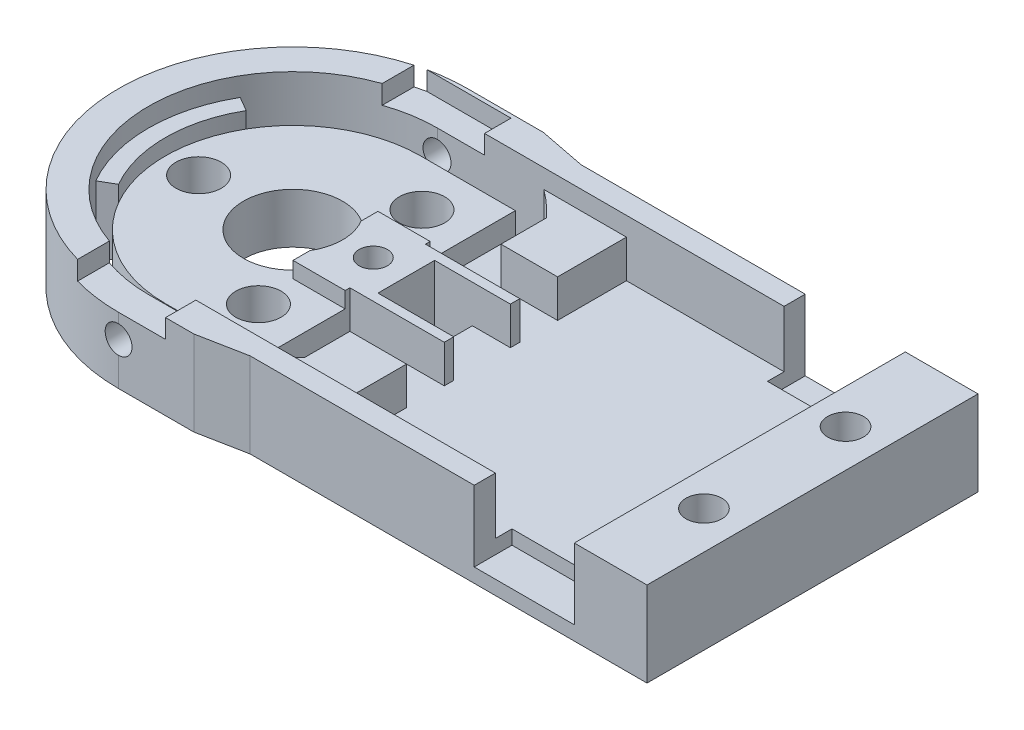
ISO-10303-21;
HEADER;
FILE_DESCRIPTION(('STEP AP214'),'2;1');
FILE_NAME('part.step','',(''),(''),'','','');
FILE_SCHEMA(('AUTOMOTIVE_DESIGN { 1 0 10303 214 1 1 1 1 }'));
ENDSEC;
DATA;
#1=APPLICATION_CONTEXT('core data for automotive mechanical design processes');
#2=APPLICATION_PROTOCOL_DEFINITION('international standard','automotive_design',2000,#1);
#3=PRODUCT_CONTEXT('',#1,'mechanical');
#4=PRODUCT('Part','Part','',(#3));
#5=PRODUCT_RELATED_PRODUCT_CATEGORY('part','',(#4));
#6=PRODUCT_DEFINITION_FORMATION('','',#4);
#7=PRODUCT_DEFINITION_CONTEXT('part definition',#1,'design');
#8=PRODUCT_DEFINITION('design','',#6,#7);
#9=PRODUCT_DEFINITION_SHAPE('','',#8);
#10=(LENGTH_UNIT() NAMED_UNIT(*) SI_UNIT(.MILLI.,.METRE.));
#11=(NAMED_UNIT(*) PLANE_ANGLE_UNIT() SI_UNIT($,.RADIAN.));
#12=(NAMED_UNIT(*) SI_UNIT($,.STERADIAN.) SOLID_ANGLE_UNIT());
#13=UNCERTAINTY_MEASURE_WITH_UNIT(LENGTH_MEASURE(1.E-05),#10,'distance_accuracy_value','');
#14=(GEOMETRIC_REPRESENTATION_CONTEXT(3) GLOBAL_UNCERTAINTY_ASSIGNED_CONTEXT((#13)) GLOBAL_UNIT_ASSIGNED_CONTEXT((#10,
#11,#12)) REPRESENTATION_CONTEXT('',''));
#15=CARTESIAN_POINT('',(0.,0.,0.));
#16=DIRECTION('',(0.,0.,1.));
#17=DIRECTION('',(1.,0.,0.));
#18=AXIS2_PLACEMENT_3D('',#15,#16,#17);
#19=CARTESIAN_POINT('',(-10.,0.,0.));
#20=DIRECTION('',(0.,1.,0.));
#21=DIRECTION('',(0.,0.,1.));
#22=AXIS2_PLACEMENT_3D('',#19,#20,#21);
#23=CYLINDRICAL_SURFACE('',#22,1.25);
#24=CARTESIAN_POINT('',(-10.,0.,0.));
#25=DIRECTION('',(0.,1.,0.));
#26=DIRECTION('',(0.,0.,1.));
#27=AXIS2_PLACEMENT_3D('',#24,#25,#26);
#28=CIRCLE('',#27,1.25);
#29=CARTESIAN_POINT('',(-10.,0.,1.25));
#30=VERTEX_POINT('',#29);
#31=EDGE_CURVE('E1086',#30,#30,#28,.T.);
#32=ORIENTED_EDGE('',*,*,#31,.F.);
#33=EDGE_LOOP('',(#32));
#34=FACE_BOUND('',#33,.T.);
#35=CARTESIAN_POINT('',(-10.,1.81,0.));
#36=DIRECTION('',(0.,1.,0.));
#37=DIRECTION('',(0.,0.,1.));
#38=AXIS2_PLACEMENT_3D('',#35,#36,#37);
#39=CIRCLE('',#38,1.25);
#40=CARTESIAN_POINT('',(-10.,1.81,1.25));
#41=VERTEX_POINT('',#40);
#42=EDGE_CURVE('E44',#41,#41,#39,.F.);
#43=ORIENTED_EDGE('',*,*,#42,.F.);
#44=EDGE_LOOP('',(#43));
#45=FACE_BOUND('',#44,.T.);
#46=ADVANCED_FACE('F40',(#34,#45),#23,.F.);
#47=CARTESIAN_POINT('',(5.00000000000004,0.,-8.66025403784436));
#48=DIRECTION('',(0.,1.,0.));
#49=DIRECTION('',(0.,0.,1.));
#50=AXIS2_PLACEMENT_3D('',#47,#48,#49);
#51=CYLINDRICAL_SURFACE('',#50,1.25);
#52=CARTESIAN_POINT('',(5.00000000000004,0.,-8.66025403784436));
#53=DIRECTION('',(0.,1.,0.));
#54=DIRECTION('',(0.,0.,1.));
#55=AXIS2_PLACEMENT_3D('',#52,#53,#54);
#56=CIRCLE('',#55,1.25);
#57=CARTESIAN_POINT('',(5.00000000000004,0.,-7.41025403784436));
#58=VERTEX_POINT('',#57);
#59=EDGE_CURVE('E1090',#58,#58,#56,.T.);
#60=ORIENTED_EDGE('',*,*,#59,.F.);
#61=EDGE_LOOP('',(#60));
#62=FACE_BOUND('',#61,.T.);
#63=CARTESIAN_POINT('',(5.00000000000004,1.81,-8.66025403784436));
#64=DIRECTION('',(0.,1.,0.));
#65=DIRECTION('',(0.,0.,1.));
#66=AXIS2_PLACEMENT_3D('',#63,#64,#65);
#67=CIRCLE('',#66,1.25);
#68=CARTESIAN_POINT('',(5.00000000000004,1.81,-7.41025403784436));
#69=VERTEX_POINT('',#68);
#70=EDGE_CURVE('E1080',#69,#69,#67,.F.);
#71=ORIENTED_EDGE('',*,*,#70,.F.);
#72=EDGE_LOOP('',(#71));
#73=FACE_BOUND('',#72,.T.);
#74=ADVANCED_FACE('F1335',(#62,#73),#51,.F.);
#75=CARTESIAN_POINT('',(4.99999999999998,0.,8.6602540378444));
#76=DIRECTION('',(0.,1.,0.));
#77=DIRECTION('',(0.,0.,1.));
#78=AXIS2_PLACEMENT_3D('',#75,#76,#77);
#79=CYLINDRICAL_SURFACE('',#78,1.25);
#80=CARTESIAN_POINT('',(4.99999999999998,0.,8.6602540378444));
#81=DIRECTION('',(0.,1.,0.));
#82=DIRECTION('',(0.,0.,1.));
#83=AXIS2_PLACEMENT_3D('',#80,#81,#82);
#84=CIRCLE('',#83,1.25);
#85=CARTESIAN_POINT('',(4.99999999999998,0.,9.9102540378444));
#86=VERTEX_POINT('',#85);
#87=EDGE_CURVE('E529',#86,#86,#84,.T.);
#88=ORIENTED_EDGE('',*,*,#87,.F.);
#89=EDGE_LOOP('',(#88));
#90=FACE_BOUND('',#89,.T.);
#91=CARTESIAN_POINT('',(4.99999999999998,1.81,8.6602540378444));
#92=DIRECTION('',(0.,1.,0.));
#93=DIRECTION('',(0.,0.,1.));
#94=AXIS2_PLACEMENT_3D('',#91,#92,#93);
#95=CIRCLE('',#94,1.25);
#96=CARTESIAN_POINT('',(4.99999999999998,1.81,9.9102540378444));
#97=VERTEX_POINT('',#96);
#98=EDGE_CURVE('E1078',#97,#97,#95,.F.);
#99=ORIENTED_EDGE('',*,*,#98,.F.);
#100=EDGE_LOOP('',(#99));
#101=FACE_BOUND('',#100,.T.);
#102=ADVANCED_FACE('F1341',(#90,#101),#79,.F.);
#103=CARTESIAN_POINT('',(0.,9.,0.));
#104=DIRECTION('',(0.,1.,0.));
#105=DIRECTION('',(0.,0.,1.));
#106=AXIS2_PLACEMENT_3D('',#103,#104,#105);
#107=PLANE('',#106);
#108=DIRECTION('',(0.,0.,-1.));
#109=VECTOR('',#108,1.);
#110=CARTESIAN_POINT('',(4.99999999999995,9.,-18.089085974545));
#111=LINE('',#110,#109);
#112=CARTESIAN_POINT('',(4.99999999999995,9.,18.5));
#113=VERTEX_POINT('',#112);
#114=CARTESIAN_POINT('',(4.99999999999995,9.,15.29));
#115=VERTEX_POINT('',#114);
#116=EDGE_CURVE('E578',#113,#115,#111,.T.);
#117=ORIENTED_EDGE('',*,*,#116,.F.);
#118=DIRECTION('',(1.,0.,0.));
#119=VECTOR('',#118,1.);
#120=CARTESIAN_POINT('',(8.,9.,18.5));
#121=LINE('',#120,#119);
#122=CARTESIAN_POINT('',(8.,9.,18.5));
#123=VERTEX_POINT('',#122);
#124=EDGE_CURVE('E690',#113,#123,#121,.T.);
#125=ORIENTED_EDGE('',*,*,#124,.T.);
#126=DIRECTION('',(0.981676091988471,0.,-0.190557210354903));
#127=VECTOR('',#126,1.);
#128=CARTESIAN_POINT('',(13.,9.,17.5294293));
#129=LINE('',#128,#127);
#130=CARTESIAN_POINT('',(13.,9.,17.5294293));
#131=VERTEX_POINT('',#130);
#132=EDGE_CURVE('E692',#123,#131,#129,.T.);
#133=ORIENTED_EDGE('',*,*,#132,.T.);
#134=DIRECTION('',(1.,0.,0.));
#135=VECTOR('',#134,1.);
#136=CARTESIAN_POINT('',(51.025,9.,17.5294293));
#137=LINE('',#136,#135);
#138=CARTESIAN_POINT('',(36.725,9.,17.5294293));
#139=VERTEX_POINT('',#138);
#140=EDGE_CURVE('E1053',#131,#139,#137,.T.);
#141=ORIENTED_EDGE('',*,*,#140,.T.);
#142=DIRECTION('',(0.,0.,1.));
#143=VECTOR('',#142,1.);
#144=CARTESIAN_POINT('',(36.725,9.,15.29));
#145=LINE('',#144,#143);
#146=CARTESIAN_POINT('',(36.725,9.,15.29));
#147=VERTEX_POINT('',#146);
#148=EDGE_CURVE('E491',#147,#139,#145,.T.);
#149=ORIENTED_EDGE('',*,*,#148,.F.);
#150=DIRECTION('',(1.,0.,0.));
#151=VECTOR('',#150,1.);
#152=CARTESIAN_POINT('',(0.,9.,15.29));
#153=LINE('',#152,#151);
#154=EDGE_CURVE('E1039',#115,#147,#153,.T.);
#155=ORIENTED_EDGE('',*,*,#154,.F.);
#156=EDGE_LOOP('',(#117,#125,#133,#141,#149,#155));
#157=FACE_BOUND('',#156,.T.);
#158=ADVANCED_FACE('F1298',(#157),#107,.T.);
#159=DIRECTION('',(0.,0.,1.));
#160=VECTOR('',#159,1.);
#161=CARTESIAN_POINT('',(-5.00000000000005,9.,-18.089085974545));
#162=LINE('',#161,#160);
#163=CARTESIAN_POINT('',(-5.00000000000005,9.,-17.8115131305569));
#164=VERTEX_POINT('',#163);
#165=CARTESIAN_POINT('',(-5.00000000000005,9.,-14.4493633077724));
#166=VERTEX_POINT('',#165);
#167=EDGE_CURVE('E569',#164,#166,#162,.T.);
#168=ORIENTED_EDGE('',*,*,#167,.F.);
#169=CARTESIAN_POINT('',(0.,9.,0.));
#170=DIRECTION('',(0.,1.,0.));
#171=DIRECTION('',(0.,0.,1.));
#172=AXIS2_PLACEMENT_3D('',#169,#170,#171);
#173=CIRCLE('',#172,18.5);
#174=CARTESIAN_POINT('',(-5.00000000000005,9.,17.8115131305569));
#175=VERTEX_POINT('',#174);
#176=EDGE_CURVE('E674',#164,#175,#173,.T.);
#177=ORIENTED_EDGE('',*,*,#176,.T.);
#178=CARTESIAN_POINT('',(-5.00000000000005,9.,14.4493633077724));
#179=VERTEX_POINT('',#178);
#180=EDGE_CURVE('E581',#179,#175,#162,.T.);
#181=ORIENTED_EDGE('',*,*,#180,.F.);
#182=CARTESIAN_POINT('',(0.,9.,0.));
#183=DIRECTION('',(0.,1.,0.));
#184=DIRECTION('',(0.,0.,1.));
#185=AXIS2_PLACEMENT_3D('',#182,#183,#184);
#186=CIRCLE('',#185,15.29);
#187=EDGE_CURVE('E1036',#166,#179,#186,.T.);
#188=ORIENTED_EDGE('',*,*,#187,.F.);
#189=EDGE_LOOP('',(#168,#177,#181,#188));
#190=FACE_BOUND('',#189,.T.);
#191=ADVANCED_FACE('F659',(#190),#107,.T.);
#192=CARTESIAN_POINT('',(0.,7.,0.));
#193=DIRECTION('',(0.,1.,0.));
#194=DIRECTION('',(0.,0.,1.));
#195=AXIS2_PLACEMENT_3D('',#192,#193,#194);
#196=CYLINDRICAL_SURFACE('',#195,15.29);
#197=ORIENTED_EDGE('',*,*,#187,.T.);
#198=DIRECTION('',(0.,1.,0.));
#199=VECTOR('',#198,1.);
#200=CARTESIAN_POINT('',(-5.00000000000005,7.,14.4493633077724));
#201=LINE('',#200,#199);
#202=CARTESIAN_POINT('',(-5.00000000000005,7.,14.4493633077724));
#203=VERTEX_POINT('',#202);
#204=EDGE_CURVE('E610',#179,#203,#201,.F.);
#205=ORIENTED_EDGE('',*,*,#204,.T.);
#206=CARTESIAN_POINT('',(0.,7.,0.));
#207=DIRECTION('',(0.,1.,0.));
#208=DIRECTION('',(0.,0.,1.));
#209=AXIS2_PLACEMENT_3D('',#206,#207,#208);
#210=CIRCLE('',#209,15.29);
#211=CARTESIAN_POINT('',(0.,7.,15.29));
#212=VERTEX_POINT('',#211);
#213=EDGE_CURVE('E592',#212,#203,#210,.F.);
#214=ORIENTED_EDGE('',*,*,#213,.F.);
#215=DIRECTION('',(0.,1.,0.));
#216=VECTOR('',#215,1.);
#217=CARTESIAN_POINT('',(0.,7.,15.29));
#218=LINE('',#217,#216);
#219=CARTESIAN_POINT('',(0.,5.95,15.29));
#220=VERTEX_POINT('',#219);
#221=EDGE_CURVE('E1046',#220,#212,#218,.T.);
#222=ORIENTED_EDGE('',*,*,#221,.F.);
#223=CARTESIAN_POINT('',(0.,5.95,15.29));
#224=CARTESIAN_POINT('',(-0.0406972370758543,5.94999983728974,15.290000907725));
#225=CARTESIAN_POINT('',(-0.0813748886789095,5.94828554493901,15.2898373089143));
#226=CARTESIAN_POINT('',(-0.162437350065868,5.94144724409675,15.2891907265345));
#227=CARTESIAN_POINT('',(-0.202822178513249,5.93632345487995,15.2887077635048));
#228=CARTESIAN_POINT('',(-0.323022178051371,5.91588957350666,15.2867965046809));
#229=CARTESIAN_POINT('',(-0.402029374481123,5.89551681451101,15.2849057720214));
#230=CARTESIAN_POINT('',(-0.555480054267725,5.84184974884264,15.2800999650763));
#231=CARTESIAN_POINT('',(-0.629921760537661,5.80855044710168,15.2771844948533));
#232=CARTESIAN_POINT('',(-0.772161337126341,5.72998515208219,15.270656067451));
#233=CARTESIAN_POINT('',(-0.839960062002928,5.68472070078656,15.2670432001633));
#234=CARTESIAN_POINT('',(-0.967197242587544,5.58335834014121,15.2595121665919));
#235=CARTESIAN_POINT('',(-1.02661176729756,5.5272304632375,15.2555931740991));
#236=CARTESIAN_POINT('',(-1.13519973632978,5.40579075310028,15.2478979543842));
#237=CARTESIAN_POINT('',(-1.184371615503,5.34047751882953,15.244121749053));
#238=CARTESIAN_POINT('',(-1.27115438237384,5.20237441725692,15.2371313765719));
#239=CARTESIAN_POINT('',(-1.30874337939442,5.12957073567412,15.233918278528));
#240=CARTESIAN_POINT('',(-1.37115179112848,4.97865391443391,15.2284283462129));
#241=CARTESIAN_POINT('',(-1.39597226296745,4.90054121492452,15.2261514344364));
#242=CARTESIAN_POINT('',(-1.43207001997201,4.74146883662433,15.2227989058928));
#243=CARTESIAN_POINT('',(-1.44338782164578,4.66051842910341,15.2217196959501));
#244=CARTESIAN_POINT('',(-1.45228425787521,4.49785836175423,15.2208735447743));
#245=CARTESIAN_POINT('',(-1.44986288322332,4.41614870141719,15.2211066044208));
#246=CARTESIAN_POINT('',(-1.431382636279,4.25457280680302,15.2228554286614));
#247=CARTESIAN_POINT('',(-1.41536833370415,4.17470142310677,15.2243670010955));
#248=CARTESIAN_POINT('',(-1.37022619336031,4.01878563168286,15.2284959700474));
#249=CARTESIAN_POINT('',(-1.34109825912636,3.94274125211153,15.2311133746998));
#250=CARTESIAN_POINT('',(-1.27050563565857,3.79649504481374,15.2371639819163));
#251=CARTESIAN_POINT('',(-1.22902085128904,3.72630297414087,15.2405985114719));
#252=CARTESIAN_POINT('',(-1.13490842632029,3.59386418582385,15.2478950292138));
#253=CARTESIAN_POINT('',(-1.08228099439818,3.53161731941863,15.2517570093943));
#254=CARTESIAN_POINT('',(-0.967136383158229,3.41658139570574,15.2594915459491));
#255=CARTESIAN_POINT('',(-0.904582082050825,3.36382949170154,15.2633640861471));
#256=CARTESIAN_POINT('',(-0.771461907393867,3.26955339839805,15.2706706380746));
#257=CARTESIAN_POINT('',(-0.700893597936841,3.22803263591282,15.2741045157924));
#258=CARTESIAN_POINT('',(-0.553714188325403,3.15740060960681,15.2801482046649));
#259=CARTESIAN_POINT('',(-0.477098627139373,3.12829861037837,15.2827574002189));
#260=CARTESIAN_POINT('',(-0.320095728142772,3.08342571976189,15.2868497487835));
#261=CARTESIAN_POINT('',(-0.239714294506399,3.06763465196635,15.2883346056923));
#262=CARTESIAN_POINT('',(-0.132310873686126,3.05580411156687,15.2894505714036));
#263=CARTESIAN_POINT('',(-0.105872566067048,3.05362648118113,15.2896564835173));
#264=CARTESIAN_POINT('',(-0.0529598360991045,3.05072639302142,15.2899310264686));
#265=CARTESIAN_POINT('',(-0.0264855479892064,3.05000150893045,15.2899998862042));
#266=CARTESIAN_POINT('',(0.,3.05,15.29));
#267=B_SPLINE_CURVE_WITH_KNOTS('',3,(#223,#224,#225,#226,#227,#228,#229,#230,#231,#232,#233,
#234,#235,#236,#237,#238,#239,#240,#241,#242,#243,#244,#245,#246,#247,#248,#249,#250,#251,#252,
#253,#254,#255,#256,#257,#258,#259,#260,#261,#262,#263,#264,#265,#266),.UNSPECIFIED.,.F.,.F.,(4,
2,2,2,2,2,2,2,2,2,2,2,2,2,2,2,2,2,2,2,2,4),(0.,0.122016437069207,0.244025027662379,
0.487608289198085,0.731285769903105,0.974931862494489,1.21925990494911,1.46362525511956,
1.70844964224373,1.95325375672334,2.19732144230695,2.44138929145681,2.68465994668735,
2.92793239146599,3.17160263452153,3.4152683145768,3.65986764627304,3.90454152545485,
4.14939761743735,4.3938818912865,4.47343900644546,4.55286313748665),.UNSPECIFIED.);
#268=CARTESIAN_POINT('',(0.,3.05,15.29));
#269=VERTEX_POINT('',#268);
#270=EDGE_CURVE('E667',#220,#269,#267,.T.);
#271=ORIENTED_EDGE('',*,*,#270,.T.);
#272=CARTESIAN_POINT('',(0.,0.,15.29));
#273=VERTEX_POINT('',#272);
#274=EDGE_CURVE('E1042',#273,#269,#218,.T.);
#275=ORIENTED_EDGE('',*,*,#274,.F.);
#276=CARTESIAN_POINT('',(0.,0.,0.));
#277=DIRECTION('',(0.,1.,0.));
#278=DIRECTION('',(0.,0.,1.));
#279=AXIS2_PLACEMENT_3D('',#276,#277,#278);
#280=CIRCLE('',#279,15.29);
#281=CARTESIAN_POINT('',(-13.2415284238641,0.,7.64499999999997));
#282=VERTEX_POINT('',#281);
#283=EDGE_CURVE('E965',#273,#282,#280,.F.);
#284=ORIENTED_EDGE('',*,*,#283,.T.);
#285=DIRECTION('',(0.,1.,0.));
#286=VECTOR('',#285,1.);
#287=CARTESIAN_POINT('',(-13.2415284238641,-27.9151578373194,7.64499999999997));
#288=LINE('',#287,#286);
#289=CARTESIAN_POINT('',(-13.2415284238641,7.,7.64499999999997));
#290=VERTEX_POINT('',#289);
#291=EDGE_CURVE('E960',#282,#290,#288,.T.);
#292=ORIENTED_EDGE('',*,*,#291,.T.);
#293=CARTESIAN_POINT('',(0.,7.,0.));
#294=DIRECTION('',(0.,1.,0.));
#295=DIRECTION('',(0.,0.,1.));
#296=AXIS2_PLACEMENT_3D('',#293,#294,#295);
#297=CIRCLE('',#296,15.29);
#298=CARTESIAN_POINT('',(-13.2415284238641,7.,-7.64499999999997));
#299=VERTEX_POINT('',#298);
#300=EDGE_CURVE('E724',#299,#290,#297,.T.);
#301=ORIENTED_EDGE('',*,*,#300,.F.);
#302=DIRECTION('',(0.,1.,0.));
#303=VECTOR('',#302,1.);
#304=CARTESIAN_POINT('',(-13.2415284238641,-27.9151578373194,-7.64499999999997));
#305=LINE('',#304,#303);
#306=CARTESIAN_POINT('',(-13.2415284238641,0.,-7.64499999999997));
#307=VERTEX_POINT('',#306);
#308=EDGE_CURVE('E855',#307,#299,#305,.T.);
#309=ORIENTED_EDGE('',*,*,#308,.F.);
#310=CARTESIAN_POINT('',(0.,0.,0.));
#311=DIRECTION('',(0.,1.,0.));
#312=DIRECTION('',(0.,0.,1.));
#313=AXIS2_PLACEMENT_3D('',#310,#311,#312);
#314=CIRCLE('',#313,15.29);
#315=CARTESIAN_POINT('',(0.,0.,-15.29));
#316=VERTEX_POINT('',#315);
#317=EDGE_CURVE('E888',#316,#307,#314,.T.);
#318=ORIENTED_EDGE('',*,*,#317,.F.);
#319=DIRECTION('',(0.,1.,0.));
#320=VECTOR('',#319,1.);
#321=CARTESIAN_POINT('',(0.,7.,-15.29));
#322=LINE('',#321,#320);
#323=CARTESIAN_POINT('',(0.,3.05,-15.29));
#324=VERTEX_POINT('',#323);
#325=EDGE_CURVE('E1047',#316,#324,#322,.T.);
#326=ORIENTED_EDGE('',*,*,#325,.T.);
#327=CARTESIAN_POINT('',(0.,5.95,-15.29));
#328=CARTESIAN_POINT('',(-0.0406972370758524,5.94999983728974,-15.290000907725));
#329=CARTESIAN_POINT('',(-0.0813748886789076,5.94828554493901,-15.2898373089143));
#330=CARTESIAN_POINT('',(-0.162437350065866,5.94144724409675,-15.2891907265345));
#331=CARTESIAN_POINT('',(-0.202822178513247,5.93632345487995,-15.2887077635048));
#332=CARTESIAN_POINT('',(-0.32302217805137,5.91588957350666,-15.2867965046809));
#333=CARTESIAN_POINT('',(-0.402029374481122,5.89551681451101,-15.2849057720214));
#334=CARTESIAN_POINT('',(-0.555480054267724,5.84184974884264,-15.2800999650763));
#335=CARTESIAN_POINT('',(-0.62992176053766,5.80855044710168,-15.2771844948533));
#336=CARTESIAN_POINT('',(-0.77216133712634,5.72998515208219,-15.270656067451));
#337=CARTESIAN_POINT('',(-0.839960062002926,5.68472070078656,-15.2670432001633));
#338=CARTESIAN_POINT('',(-0.967197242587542,5.58335834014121,-15.2595121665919));
#339=CARTESIAN_POINT('',(-1.02661176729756,5.5272304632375,-15.2555931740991));
#340=CARTESIAN_POINT('',(-1.13519973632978,5.40579075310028,-15.2478979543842));
#341=CARTESIAN_POINT('',(-1.184371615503,5.34047751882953,-15.244121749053));
#342=CARTESIAN_POINT('',(-1.27115438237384,5.20237441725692,-15.2371313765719));
#343=CARTESIAN_POINT('',(-1.30874337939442,5.12957073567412,-15.233918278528));
#344=CARTESIAN_POINT('',(-1.37115179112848,4.97865391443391,-15.2284283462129));
#345=CARTESIAN_POINT('',(-1.39597226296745,4.90054121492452,-15.2261514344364));
#346=CARTESIAN_POINT('',(-1.43207001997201,4.74146883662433,-15.2227989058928));
#347=CARTESIAN_POINT('',(-1.44338782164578,4.66051842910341,-15.2217196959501));
#348=CARTESIAN_POINT('',(-1.45228425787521,4.49785836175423,-15.2208735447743));
#349=CARTESIAN_POINT('',(-1.44986288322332,4.41614870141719,-15.2211066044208));
#350=CARTESIAN_POINT('',(-1.431382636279,4.25457280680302,-15.2228554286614));
#351=CARTESIAN_POINT('',(-1.41536833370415,4.17470142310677,-15.2243670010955));
#352=CARTESIAN_POINT('',(-1.37022619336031,4.01878563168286,-15.2284959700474));
#353=CARTESIAN_POINT('',(-1.34109825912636,3.94274125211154,-15.2311133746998));
#354=CARTESIAN_POINT('',(-1.27050563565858,3.79649504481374,-15.2371639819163));
#355=CARTESIAN_POINT('',(-1.22902085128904,3.72630297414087,-15.2405985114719));
#356=CARTESIAN_POINT('',(-1.13490842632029,3.59386418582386,-15.2478950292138));
#357=CARTESIAN_POINT('',(-1.08228099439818,3.53161731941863,-15.2517570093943));
#358=CARTESIAN_POINT('',(-0.96713638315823,3.41658139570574,-15.2594915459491));
#359=CARTESIAN_POINT('',(-0.904582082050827,3.36382949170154,-15.2633640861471));
#360=CARTESIAN_POINT('',(-0.771461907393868,3.26955339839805,-15.2706706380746));
#361=CARTESIAN_POINT('',(-0.700893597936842,3.22803263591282,-15.2741045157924));
#362=CARTESIAN_POINT('',(-0.553714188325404,3.15740060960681,-15.2801482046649));
#363=CARTESIAN_POINT('',(-0.477098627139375,3.12829861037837,-15.2827574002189));
#364=CARTESIAN_POINT('',(-0.320095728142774,3.08342571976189,-15.2868497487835));
#365=CARTESIAN_POINT('',(-0.239714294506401,3.06763465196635,-15.2883346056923));
#366=CARTESIAN_POINT('',(-0.132310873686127,3.05580411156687,-15.2894505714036));
#367=CARTESIAN_POINT('',(-0.105872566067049,3.05362648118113,-15.2896564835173));
#368=CARTESIAN_POINT('',(-0.0529598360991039,3.05072639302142,-15.2899310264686));
#369=CARTESIAN_POINT('',(-0.0264855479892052,3.05000150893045,-15.2899998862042));
#370=CARTESIAN_POINT('',(0.,3.05,-15.29));
#371=B_SPLINE_CURVE_WITH_KNOTS('',3,(#327,#328,#329,#330,#331,#332,#333,#334,#335,#336,#337,
#338,#339,#340,#341,#342,#343,#344,#345,#346,#347,#348,#349,#350,#351,#352,#353,#354,#355,#356,
#357,#358,#359,#360,#361,#362,#363,#364,#365,#366,#367,#368,#369,#370),.UNSPECIFIED.,.F.,.F.,(4,
2,2,2,2,2,2,2,2,2,2,2,2,2,2,2,2,2,2,2,2,4),(0.,0.122016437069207,0.244025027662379,
0.487608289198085,0.731285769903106,0.97493186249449,1.21925990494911,1.46362525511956,
1.70844964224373,1.95325375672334,2.19732144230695,2.44138929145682,2.68465994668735,
2.92793239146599,3.17160263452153,3.4152683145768,3.65986764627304,3.90454152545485,
4.14939761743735,4.3938818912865,4.47343900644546,4.55286313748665),.UNSPECIFIED.);
#372=CARTESIAN_POINT('',(0.,5.95,-15.29));
#373=VERTEX_POINT('',#372);
#374=EDGE_CURVE('E641',#373,#324,#371,.T.);
#375=ORIENTED_EDGE('',*,*,#374,.F.);
#376=CARTESIAN_POINT('',(0.,7.,-15.29));
#377=VERTEX_POINT('',#376);
#378=EDGE_CURVE('E1034',#373,#377,#322,.T.);
#379=ORIENTED_EDGE('',*,*,#378,.T.);
#380=CARTESIAN_POINT('',(-5.00000000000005,7.,-14.4493633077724));
#381=VERTEX_POINT('',#380);
#382=EDGE_CURVE('E64',#381,#377,#210,.F.);
#383=ORIENTED_EDGE('',*,*,#382,.F.);
#384=DIRECTION('',(0.,1.,0.));
#385=VECTOR('',#384,1.);
#386=CARTESIAN_POINT('',(-5.00000000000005,7.,-14.4493633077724));
#387=LINE('',#386,#385);
#388=EDGE_CURVE('E607',#381,#166,#387,.T.);
#389=ORIENTED_EDGE('',*,*,#388,.T.);
#390=EDGE_LOOP('',(#197,#205,#214,#222,#271,#275,#284,#292,#301,#309,#318,#326,#375,#379,#383,#389));
#391=FACE_BOUND('',#390,.T.);
#392=ADVANCED_FACE('F654',(#391),#196,.F.);
#393=CARTESIAN_POINT('',(0.,-48.5926949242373,0.));
#394=DIRECTION('',(0.,1.,0.));
#395=DIRECTION('',(0.,0.,1.));
#396=AXIS2_PLACEMENT_3D('',#393,#394,#395);
#397=CYLINDRICAL_SURFACE('',#396,18.5);
#398=DIRECTION('',(0.,1.,0.));
#399=VECTOR('',#398,1.);
#400=CARTESIAN_POINT('',(-5.00000000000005,-48.5926949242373,-17.8115131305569));
#401=LINE('',#400,#399);
#402=CARTESIAN_POINT('',(-5.00000000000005,7.,-17.8115131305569));
#403=VERTEX_POINT('',#402);
#404=EDGE_CURVE('E603',#403,#164,#401,.T.);
#405=ORIENTED_EDGE('',*,*,#404,.F.);
#406=CARTESIAN_POINT('',(0.,7.,0.));
#407=DIRECTION('',(0.,1.,0.));
#408=DIRECTION('',(0.,0.,1.));
#409=AXIS2_PLACEMENT_3D('',#406,#407,#408);
#410=CIRCLE('',#409,18.5);
#411=CARTESIAN_POINT('',(-3.87749514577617,7.,-18.089085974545));
#412=VERTEX_POINT('',#411);
#413=EDGE_CURVE('E590',#403,#412,#410,.F.);
#414=ORIENTED_EDGE('',*,*,#413,.T.);
#415=DIRECTION('',(0.,1.,0.));
#416=VECTOR('',#415,1.);
#417=CARTESIAN_POINT('',(-3.87749514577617,-48.5926949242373,-18.089085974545));
#418=LINE('',#417,#416);
#419=CARTESIAN_POINT('',(-3.87749514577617,9.,-18.089085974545));
#420=VERTEX_POINT('',#419);
#421=EDGE_CURVE('E601',#420,#412,#418,.F.);
#422=ORIENTED_EDGE('',*,*,#421,.F.);
#423=CARTESIAN_POINT('',(0.,9.,-18.5));
#424=VERTEX_POINT('',#423);
#425=EDGE_CURVE('E687',#424,#420,#173,.T.);
#426=ORIENTED_EDGE('',*,*,#425,.F.);
#427=DIRECTION('',(0.,1.,0.));
#428=VECTOR('',#427,1.);
#429=CARTESIAN_POINT('',(0.,-48.5926949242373,-18.5));
#430=LINE('',#429,#428);
#431=CARTESIAN_POINT('',(0.,5.95,-18.5));
#432=VERTEX_POINT('',#431);
#433=EDGE_CURVE('E704',#432,#424,#430,.T.);
#434=ORIENTED_EDGE('',*,*,#433,.F.);
#435=CARTESIAN_POINT('',(0.,5.95,-18.5));
#436=CARTESIAN_POINT('',(-0.0407279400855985,5.94999980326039,-18.5000007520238));
#437=CARTESIAN_POINT('',(-0.0814363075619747,5.94828295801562,-18.4998653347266));
#438=CARTESIAN_POINT('',(-0.162560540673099,5.94143424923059,-18.499330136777));
#439=CARTESIAN_POINT('',(-0.20297642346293,5.93630258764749,-18.4989303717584));
#440=CARTESIAN_POINT('',(-0.323274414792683,5.91583599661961,-18.4973483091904));
#441=CARTESIAN_POINT('',(-0.402348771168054,5.89542931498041,-18.4957831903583));
#442=CARTESIAN_POINT('',(-0.555932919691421,5.8416669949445,-18.4918052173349));
#443=CARTESIAN_POINT('',(-0.630440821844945,5.80830603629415,-18.4893920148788));
#444=CARTESIAN_POINT('',(-0.772799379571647,5.72959012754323,-18.483989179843));
#445=CARTESIAN_POINT('',(-0.84065103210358,5.68423697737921,-18.4809996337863));
#446=CARTESIAN_POINT('',(-0.967914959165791,5.58271892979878,-18.4747724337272));
#447=CARTESIAN_POINT('',(-1.02731074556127,5.52653339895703,-18.4715343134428));
#448=CARTESIAN_POINT('',(-1.13584693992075,5.40498124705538,-18.4651784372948));
#449=CARTESIAN_POINT('',(-1.18498578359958,5.33961322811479,-18.4620606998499));
#450=CARTESIAN_POINT('',(-1.27165994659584,5.20145515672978,-18.4562937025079));
#451=CARTESIAN_POINT('',(-1.30918055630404,5.12865584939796,-18.4536450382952));
#452=CARTESIAN_POINT('',(-1.37145738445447,4.97777093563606,-18.4491215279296));
#453=CARTESIAN_POINT('',(-1.39621458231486,4.89968573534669,-18.4472466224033));
#454=CARTESIAN_POINT('',(-1.43221597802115,4.74061153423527,-18.4444866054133));
#455=CARTESIAN_POINT('',(-1.44348781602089,4.6596288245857,-18.4435994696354));
#456=CARTESIAN_POINT('',(-1.45228396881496,4.49691436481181,-18.4429089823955));
#457=CARTESIAN_POINT('',(-1.44980817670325,4.41518260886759,-18.4431056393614));
#458=CARTESIAN_POINT('',(-1.43120172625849,4.25348376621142,-18.4445587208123));
#459=CARTESIAN_POINT('',(-1.41510147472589,4.17351315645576,-18.4458127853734));
#460=CARTESIAN_POINT('',(-1.36975040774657,4.01741330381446,-18.449235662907));
#461=CARTESIAN_POINT('',(-1.34049953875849,3.94128407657,-18.4514044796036));
#462=CARTESIAN_POINT('',(-1.26964274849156,3.79492905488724,-18.456415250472));
#463=CARTESIAN_POINT('',(-1.22802289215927,3.72471003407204,-18.4592579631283));
#464=CARTESIAN_POINT('',(-1.13362152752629,3.59224640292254,-18.4652953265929));
#465=CARTESIAN_POINT('',(-1.08084033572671,3.53000156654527,-18.4684899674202));
#466=CARTESIAN_POINT('',(-0.965452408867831,3.41508090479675,-18.4748813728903));
#467=CARTESIAN_POINT('',(-0.90282077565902,3.36243007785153,-18.4780781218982));
#468=CARTESIAN_POINT('',(-0.76956984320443,3.26836971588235,-18.4841067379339));
#469=CARTESIAN_POINT('',(-0.698948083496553,3.22696365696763,-18.4869384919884));
#470=CARTESIAN_POINT('',(-0.551696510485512,3.15657153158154,-18.4919188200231));
#471=CARTESIAN_POINT('',(-0.475062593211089,3.12759403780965,-18.4940669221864));
#472=CARTESIAN_POINT('',(-0.318054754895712,3.08296786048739,-18.4974316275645));
#473=CARTESIAN_POINT('',(-0.237686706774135,3.06729894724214,-18.4986496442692));
#474=CARTESIAN_POINT('',(-0.130639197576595,3.0556580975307,-18.4995573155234));
#475=CARTESIAN_POINT('',(-0.104533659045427,3.05353522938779,-18.4997232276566));
#476=CARTESIAN_POINT('',(-0.0522890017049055,3.05070810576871,-18.4999444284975));
#477=CARTESIAN_POINT('',(-0.0261500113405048,3.05000149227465,-18.4999999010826));
#478=CARTESIAN_POINT('',(0.,3.05,-18.5));
#479=B_SPLINE_CURVE_WITH_KNOTS('',3,(#435,#436,#437,#438,#439,#440,#441,#442,#443,#444,#445,
#446,#447,#448,#449,#450,#451,#452,#453,#454,#455,#456,#457,#458,#459,#460,#461,#462,#463,#464,
#465,#466,#467,#468,#469,#470,#471,#472,#473,#474,#475,#476,#477,#478),.UNSPECIFIED.,.F.,.F.,(4,
2,2,2,2,2,2,2,2,2,2,2,2,2,2,2,2,2,2,2,2,4),(0.,0.122108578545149,0.244209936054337,
0.487992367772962,0.731875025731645,0.975721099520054,1.22003632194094,1.46438877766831,
1.70904934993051,1.95369114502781,2.1978306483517,2.4419720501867,2.68557001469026,
2.92916897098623,3.17304341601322,3.41691094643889,3.6614050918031,3.90597473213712,
4.1507127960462,4.39507817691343,4.47362746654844,4.55204586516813),.UNSPECIFIED.);
#480=CARTESIAN_POINT('',(0.,3.05,-18.5));
#481=VERTEX_POINT('',#480);
#482=EDGE_CURVE('E613',#432,#481,#479,.T.);
#483=ORIENTED_EDGE('',*,*,#482,.T.);
#484=CARTESIAN_POINT('',(0.,0.,-18.5));
#485=VERTEX_POINT('',#484);
#486=EDGE_CURVE('E679',#485,#481,#430,.T.);
#487=ORIENTED_EDGE('',*,*,#486,.F.);
#488=CARTESIAN_POINT('',(0.,0.,0.));
#489=DIRECTION('',(0.,1.,0.));
#490=DIRECTION('',(0.,0.,1.));
#491=AXIS2_PLACEMENT_3D('',#488,#489,#490);
#492=CIRCLE('',#491,18.5);
#493=CARTESIAN_POINT('',(0.,0.,18.5));
#494=VERTEX_POINT('',#493);
#495=EDGE_CURVE('E684',#494,#485,#492,.F.);
#496=ORIENTED_EDGE('',*,*,#495,.F.);
#497=DIRECTION('',(0.,1.,0.));
#498=VECTOR('',#497,1.);
#499=CARTESIAN_POINT('',(0.,-48.5926949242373,18.5));
#500=LINE('',#499,#498);
#501=CARTESIAN_POINT('',(0.,3.05,18.5));
#502=VERTEX_POINT('',#501);
#503=EDGE_CURVE('E715',#494,#502,#500,.T.);
#504=ORIENTED_EDGE('',*,*,#503,.T.);
#505=CARTESIAN_POINT('',(0.,5.95,18.5));
#506=CARTESIAN_POINT('',(-0.0407279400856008,5.94999980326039,18.5000007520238));
#507=CARTESIAN_POINT('',(-0.081436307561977,5.94828295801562,18.4998653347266));
#508=CARTESIAN_POINT('',(-0.162560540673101,5.94143424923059,18.499330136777));
#509=CARTESIAN_POINT('',(-0.202976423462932,5.93630258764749,18.4989303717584));
#510=CARTESIAN_POINT('',(-0.323274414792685,5.91583599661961,18.4973483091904));
#511=CARTESIAN_POINT('',(-0.402348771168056,5.89542931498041,18.4957831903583));
#512=CARTESIAN_POINT('',(-0.555932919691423,5.8416669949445,18.4918052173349));
#513=CARTESIAN_POINT('',(-0.630440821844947,5.80830603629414,18.4893920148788));
#514=CARTESIAN_POINT('',(-0.772799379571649,5.72959012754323,18.483989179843));
#515=CARTESIAN_POINT('',(-0.840651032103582,5.68423697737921,18.4809996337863));
#516=CARTESIAN_POINT('',(-0.967914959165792,5.58271892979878,18.4747724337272));
#517=CARTESIAN_POINT('',(-1.02731074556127,5.52653339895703,18.4715343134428));
#518=CARTESIAN_POINT('',(-1.13584693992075,5.40498124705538,18.4651784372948));
#519=CARTESIAN_POINT('',(-1.18498578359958,5.33961322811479,18.4620606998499));
#520=CARTESIAN_POINT('',(-1.27165994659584,5.20145515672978,18.4562937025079));
#521=CARTESIAN_POINT('',(-1.30918055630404,5.12865584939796,18.4536450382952));
#522=CARTESIAN_POINT('',(-1.37145738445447,4.97777093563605,18.4491215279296));
#523=CARTESIAN_POINT('',(-1.39621458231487,4.89968573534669,18.4472466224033));
#524=CARTESIAN_POINT('',(-1.43221597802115,4.74061153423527,18.4444866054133));
#525=CARTESIAN_POINT('',(-1.44348781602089,4.6596288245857,18.4435994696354));
#526=CARTESIAN_POINT('',(-1.45228396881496,4.49691436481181,18.4429089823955));
#527=CARTESIAN_POINT('',(-1.44980817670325,4.41518260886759,18.4431056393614));
#528=CARTESIAN_POINT('',(-1.43120172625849,4.25348376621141,18.4445587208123));
#529=CARTESIAN_POINT('',(-1.41510147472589,4.17351315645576,18.4458127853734));
#530=CARTESIAN_POINT('',(-1.36975040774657,4.01741330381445,18.449235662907));
#531=CARTESIAN_POINT('',(-1.34049953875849,3.94128407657,18.4514044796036));
#532=CARTESIAN_POINT('',(-1.26964274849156,3.79492905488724,18.456415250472));
#533=CARTESIAN_POINT('',(-1.22802289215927,3.72471003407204,18.4592579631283));
#534=CARTESIAN_POINT('',(-1.13362152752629,3.59224640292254,18.4652953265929));
#535=CARTESIAN_POINT('',(-1.08084033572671,3.53000156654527,18.4684899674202));
#536=CARTESIAN_POINT('',(-0.96545240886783,3.41508090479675,18.4748813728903));
#537=CARTESIAN_POINT('',(-0.902820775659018,3.36243007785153,18.4780781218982));
#538=CARTESIAN_POINT('',(-0.769569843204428,3.26836971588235,18.4841067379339));
#539=CARTESIAN_POINT('',(-0.698948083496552,3.22696365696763,18.4869384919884));
#540=CARTESIAN_POINT('',(-0.551696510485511,3.15657153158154,18.4919188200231));
#541=CARTESIAN_POINT('',(-0.475062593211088,3.12759403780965,18.4940669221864));
#542=CARTESIAN_POINT('',(-0.318054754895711,3.08296786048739,18.4974316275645));
#543=CARTESIAN_POINT('',(-0.237686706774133,3.06729894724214,18.4986496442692));
#544=CARTESIAN_POINT('',(-0.130639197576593,3.0556580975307,18.4995573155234));
#545=CARTESIAN_POINT('',(-0.104533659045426,3.05353522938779,18.4997232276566));
#546=CARTESIAN_POINT('',(-0.052289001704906,3.05070810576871,18.4999444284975));
#547=CARTESIAN_POINT('',(-0.0261500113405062,3.05000149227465,18.4999999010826));
#548=CARTESIAN_POINT('',(0.,3.05,18.5));
#549=B_SPLINE_CURVE_WITH_KNOTS('',3,(#505,#506,#507,#508,#509,#510,#511,#512,#513,#514,#515,
#516,#517,#518,#519,#520,#521,#522,#523,#524,#525,#526,#527,#528,#529,#530,#531,#532,#533,#534,
#535,#536,#537,#538,#539,#540,#541,#542,#543,#544,#545,#546,#547,#548),.UNSPECIFIED.,.F.,.F.,(4,
2,2,2,2,2,2,2,2,2,2,2,2,2,2,2,2,2,2,2,2,4),(0.,0.122108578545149,0.244209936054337,
0.487992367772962,0.731875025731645,0.975721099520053,1.22003632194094,1.46438877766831,
1.70904934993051,1.95369114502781,2.19783064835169,2.4419720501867,2.68557001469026,
2.92916897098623,3.17304341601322,3.41691094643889,3.6614050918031,3.90597473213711,
4.1507127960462,4.39507817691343,4.47362746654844,4.55204586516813),.UNSPECIFIED.);
#550=CARTESIAN_POINT('',(0.,5.95,18.5));
#551=VERTEX_POINT('',#550);
#552=EDGE_CURVE('E648',#551,#502,#549,.T.);
#553=ORIENTED_EDGE('',*,*,#552,.F.);
#554=CARTESIAN_POINT('',(0.,6.99999999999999,18.5));
#555=VERTEX_POINT('',#554);
#556=EDGE_CURVE('E701',#551,#555,#500,.T.);
#557=ORIENTED_EDGE('',*,*,#556,.T.);
#558=CARTESIAN_POINT('',(-5.00000000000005,7.,17.8115131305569));
#559=VERTEX_POINT('',#558);
#560=EDGE_CURVE('E586',#555,#559,#410,.F.);
#561=ORIENTED_EDGE('',*,*,#560,.T.);
#562=DIRECTION('',(0.,1.,0.));
#563=VECTOR('',#562,1.);
#564=CARTESIAN_POINT('',(-5.00000000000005,-48.5926949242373,17.8115131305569));
#565=LINE('',#564,#563);
#566=EDGE_CURVE('E605',#175,#559,#565,.F.);
#567=ORIENTED_EDGE('',*,*,#566,.F.);
#568=ORIENTED_EDGE('',*,*,#176,.F.);
#569=EDGE_LOOP('',(#405,#414,#422,#426,#434,#483,#487,#496,#504,#553,#557,#561,#567,#568));
#570=FACE_BOUND('',#569,.T.);
#571=ADVANCED_FACE('F624',(#570),#397,.T.);
#572=CARTESIAN_POINT('',(0.,5.31,0.));
#573=DIRECTION('',(0.,1.,0.));
#574=DIRECTION('',(0.,0.,1.));
#575=AXIS2_PLACEMENT_3D('',#572,#573,#574);
#576=PLANE('',#575);
#577=CARTESIAN_POINT('',(5.00000000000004,5.31,-8.66025403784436));
#578=DIRECTION('',(0.,1.,0.));
#579=DIRECTION('',(0.,0.,1.));
#580=AXIS2_PLACEMENT_3D('',#577,#578,#579);
#581=CIRCLE('',#580,2.4);
#582=CARTESIAN_POINT('',(5.00000000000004,5.31,-6.26025403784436));
#583=VERTEX_POINT('',#582);
#584=EDGE_CURVE('E1110',#583,#583,#581,.T.);
#585=ORIENTED_EDGE('',*,*,#584,.F.);
#586=EDGE_LOOP('',(#585));
#587=FACE_BOUND('',#586,.T.);
#588=CARTESIAN_POINT('',(4.99999999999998,5.31,8.6602540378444));
#589=DIRECTION('',(0.,1.,0.));
#590=DIRECTION('',(0.,0.,1.));
#591=AXIS2_PLACEMENT_3D('',#588,#589,#590);
#592=CIRCLE('',#591,2.4);
#593=CARTESIAN_POINT('',(4.99999999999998,5.31,11.0602540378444));
#594=VERTEX_POINT('',#593);
#595=EDGE_CURVE('E1107',#594,#594,#592,.T.);
#596=ORIENTED_EDGE('',*,*,#595,.F.);
#597=EDGE_LOOP('',(#596));
#598=FACE_BOUND('',#597,.T.);
#599=CARTESIAN_POINT('',(-10.,5.31,0.));
#600=DIRECTION('',(0.,1.,0.));
#601=DIRECTION('',(0.,0.,1.));
#602=AXIS2_PLACEMENT_3D('',#599,#600,#601);
#603=CIRCLE('',#602,2.4);
#604=CARTESIAN_POINT('',(-10.,5.31,2.4));
#605=VERTEX_POINT('',#604);
#606=EDGE_CURVE('E1101',#605,#605,#603,.T.);
#607=ORIENTED_EDGE('',*,*,#606,.F.);
#608=EDGE_LOOP('',(#607));
#609=FACE_BOUND('',#608,.T.);
#610=CARTESIAN_POINT('',(0.,5.31,0.));
#611=DIRECTION('',(0.,1.,0.));
#612=DIRECTION('',(0.,0.,1.));
#613=AXIS2_PLACEMENT_3D('',#610,#611,#612);
#614=CIRCLE('',#613,13.5294293);
#615=CARTESIAN_POINT('',(-11.7168294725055,5.31,-6.76471464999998));
#616=VERTEX_POINT('',#615);
#617=CARTESIAN_POINT('',(0.,5.31,-13.5294293));
#618=VERTEX_POINT('',#617);
#619=EDGE_CURVE('E748',#616,#618,#614,.F.);
#620=ORIENTED_EDGE('',*,*,#619,.F.);
#621=CARTESIAN_POINT('',(0.,5.31,0.));
#622=DIRECTION('',(0.,-1.,0.));
#623=DIRECTION('',(0.,0.,1.));
#624=AXIS2_PLACEMENT_3D('',#621,#622,#623);
#625=CIRCLE('',#624,13.5294293);
#626=CARTESIAN_POINT('',(-11.7168294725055,5.31,6.76471464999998));
#627=VERTEX_POINT('',#626);
#628=EDGE_CURVE('E720',#627,#616,#625,.T.);
#629=ORIENTED_EDGE('',*,*,#628,.F.);
#630=CARTESIAN_POINT('',(0.,5.31,0.));
#631=DIRECTION('',(0.,1.,0.));
#632=DIRECTION('',(0.,0.,1.));
#633=AXIS2_PLACEMENT_3D('',#630,#631,#632);
#634=CIRCLE('',#633,13.5294293);
#635=CARTESIAN_POINT('',(0.,5.31,13.5294293));
#636=VERTEX_POINT('',#635);
#637=EDGE_CURVE('E751',#636,#627,#634,.F.);
#638=ORIENTED_EDGE('',*,*,#637,.F.);
#639=DIRECTION('',(-1.,0.,0.));
#640=VECTOR('',#639,1.);
#641=CARTESIAN_POINT('',(0.,5.31,13.5294293));
#642=LINE('',#641,#640);
#643=CARTESIAN_POINT('',(10.025,5.31,13.5294293));
#644=VERTEX_POINT('',#643);
#645=EDGE_CURVE('E754',#644,#636,#642,.T.);
#646=ORIENTED_EDGE('',*,*,#645,.F.);
#647=DIRECTION('',(0.,0.,1.));
#648=VECTOR('',#647,1.);
#649=CARTESIAN_POINT('',(10.025,5.31,0.));
#650=LINE('',#649,#648);
#651=CARTESIAN_POINT('',(10.025,5.31,4.5));
#652=VERTEX_POINT('',#651);
#653=EDGE_CURVE('E757',#652,#644,#650,.T.);
#654=ORIENTED_EDGE('',*,*,#653,.F.);
#655=DIRECTION('',(-1.,0.,0.));
#656=VECTOR('',#655,1.);
#657=CARTESIAN_POINT('',(0.,5.31,4.5));
#658=LINE('',#657,#656);
#659=CARTESIAN_POINT('',(4.5,5.31,4.5));
#660=VERTEX_POINT('',#659);
#661=EDGE_CURVE('E760',#652,#660,#658,.T.);
#662=ORIENTED_EDGE('',*,*,#661,.T.);
#663=DIRECTION('',(0.,0.,-1.));
#664=VECTOR('',#663,1.);
#665=CARTESIAN_POINT('',(4.5,5.31,0.));
#666=LINE('',#665,#664);
#667=CARTESIAN_POINT('',(4.5,5.31,2.70416345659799));
#668=VERTEX_POINT('',#667);
#669=EDGE_CURVE('E763',#660,#668,#666,.T.);
#670=ORIENTED_EDGE('',*,*,#669,.T.);
#671=CARTESIAN_POINT('',(0.,5.31,0.));
#672=DIRECTION('',(0.,1.,0.));
#673=DIRECTION('',(0.,0.,1.));
#674=AXIS2_PLACEMENT_3D('',#671,#672,#673);
#675=CIRCLE('',#674,5.25);
#676=CARTESIAN_POINT('',(4.5,5.31,-2.70416345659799));
#677=VERTEX_POINT('',#676);
#678=EDGE_CURVE('E766',#677,#668,#675,.T.);
#679=ORIENTED_EDGE('',*,*,#678,.F.);
#680=DIRECTION('',(0.,0.,-1.));
#681=VECTOR('',#680,1.);
#682=CARTESIAN_POINT('',(4.5,5.31,0.));
#683=LINE('',#682,#681);
#684=CARTESIAN_POINT('',(4.5,5.31,-4.5));
#685=VERTEX_POINT('',#684);
#686=EDGE_CURVE('E742',#677,#685,#683,.T.);
#687=ORIENTED_EDGE('',*,*,#686,.T.);
#688=DIRECTION('',(-1.,0.,0.));
#689=VECTOR('',#688,1.);
#690=CARTESIAN_POINT('',(0.,5.31,-4.5));
#691=LINE('',#690,#689);
#692=CARTESIAN_POINT('',(10.025,5.31,-4.5));
#693=VERTEX_POINT('',#692);
#694=EDGE_CURVE('E739',#693,#685,#691,.T.);
#695=ORIENTED_EDGE('',*,*,#694,.F.);
#696=DIRECTION('',(0.,0.,1.));
#697=VECTOR('',#696,1.);
#698=CARTESIAN_POINT('',(10.025,5.31,0.));
#699=LINE('',#698,#697);
#700=CARTESIAN_POINT('',(10.025,5.31,-13.5294293));
#701=VERTEX_POINT('',#700);
#702=EDGE_CURVE('E741',#701,#693,#699,.T.);
#703=ORIENTED_EDGE('',*,*,#702,.F.);
#704=DIRECTION('',(1.,0.,0.));
#705=VECTOR('',#704,1.);
#706=CARTESIAN_POINT('',(0.,5.31,-13.5294293));
#707=LINE('',#706,#705);
#708=EDGE_CURVE('E745',#618,#701,#707,.T.);
#709=ORIENTED_EDGE('',*,*,#708,.F.);
#710=EDGE_LOOP('',(#620,#629,#638,#646,#654,#662,#670,#679,#687,#695,#703,#709));
#711=FACE_BOUND('',#710,.T.);
#712=ADVANCED_FACE('F1125',(#587,#598,#609,#711),#576,.T.);
#713=CARTESIAN_POINT('',(0.,7.,0.));
#714=DIRECTION('',(0.,1.,0.));
#715=DIRECTION('',(0.,0.,1.));
#716=AXIS2_PLACEMENT_3D('',#713,#714,#715);
#717=PLANE('',#716);
#718=CARTESIAN_POINT('',(0.,7.,0.));
#719=DIRECTION('',(0.,1.,0.));
#720=DIRECTION('',(0.,0.,1.));
#721=AXIS2_PLACEMENT_3D('',#718,#719,#720);
#722=CIRCLE('',#721,5.25);
#723=CARTESIAN_POINT('',(4.5,7.,-2.70416345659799));
#724=VERTEX_POINT('',#723);
#725=CARTESIAN_POINT('',(4.5,7.,2.70416345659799));
#726=VERTEX_POINT('',#725);
#727=EDGE_CURVE('E1026',#724,#726,#722,.F.);
#728=ORIENTED_EDGE('',*,*,#727,.T.);
#729=DIRECTION('',(0.,0.,1.));
#730=VECTOR('',#729,1.);
#731=CARTESIAN_POINT('',(4.5,7.,0.));
#732=LINE('',#731,#730);
#733=CARTESIAN_POINT('',(4.5,7.,4.5));
#734=VERTEX_POINT('',#733);
#735=EDGE_CURVE('E776',#726,#734,#732,.T.);
#736=ORIENTED_EDGE('',*,*,#735,.T.);
#737=DIRECTION('',(1.,0.,0.));
#738=VECTOR('',#737,1.);
#739=CARTESIAN_POINT('',(0.,7.,4.5));
#740=LINE('',#739,#738);
#741=CARTESIAN_POINT('',(10.025,7.,4.5));
#742=VERTEX_POINT('',#741);
#743=EDGE_CURVE('E774',#734,#742,#740,.T.);
#744=ORIENTED_EDGE('',*,*,#743,.T.);
#745=DIRECTION('',(0.,0.,1.));
#746=VECTOR('',#745,1.);
#747=CARTESIAN_POINT('',(10.025,7.,0.));
#748=LINE('',#747,#746);
#749=CARTESIAN_POINT('',(10.025,7.,4.));
#750=VERTEX_POINT('',#749);
#751=EDGE_CURVE('E936',#750,#742,#748,.T.);
#752=ORIENTED_EDGE('',*,*,#751,.F.);
#753=DIRECTION('',(-1.,0.,0.));
#754=VECTOR('',#753,1.);
#755=CARTESIAN_POINT('',(0.,7.,4.));
#756=LINE('',#755,#754);
#757=CARTESIAN_POINT('',(20.025,7.,4.));
#758=VERTEX_POINT('',#757);
#759=EDGE_CURVE('E933',#758,#750,#756,.T.);
#760=ORIENTED_EDGE('',*,*,#759,.F.);
#761=DIRECTION('',(0.,0.,-1.));
#762=VECTOR('',#761,1.);
#763=CARTESIAN_POINT('',(20.025,7.,0.));
#764=LINE('',#763,#762);
#765=CARTESIAN_POINT('',(20.025,7.,3.));
#766=VERTEX_POINT('',#765);
#767=EDGE_CURVE('E1068',#758,#766,#764,.T.);
#768=ORIENTED_EDGE('',*,*,#767,.T.);
#769=DIRECTION('',(1.,0.,0.));
#770=VECTOR('',#769,1.);
#771=CARTESIAN_POINT('',(16.,7.,3.));
#772=LINE('',#771,#770);
#773=CARTESIAN_POINT('',(12.,7.,3.));
#774=VERTEX_POINT('',#773);
#775=EDGE_CURVE('E825',#774,#766,#772,.T.);
#776=ORIENTED_EDGE('',*,*,#775,.F.);
#777=DIRECTION('',(0.,0.,1.));
#778=VECTOR('',#777,1.);
#779=CARTESIAN_POINT('',(12.,7.,3.));
#780=LINE('',#779,#778);
#781=CARTESIAN_POINT('',(12.,7.,-3.));
#782=VERTEX_POINT('',#781);
#783=EDGE_CURVE('E809',#782,#774,#780,.T.);
#784=ORIENTED_EDGE('',*,*,#783,.F.);
#785=DIRECTION('',(-1.,0.,0.));
#786=VECTOR('',#785,1.);
#787=CARTESIAN_POINT('',(16.,7.,-3.));
#788=LINE('',#787,#786);
#789=CARTESIAN_POINT('',(20.025,7.,-3.));
#790=VERTEX_POINT('',#789);
#791=EDGE_CURVE('E814',#790,#782,#788,.T.);
#792=ORIENTED_EDGE('',*,*,#791,.F.);
#793=CARTESIAN_POINT('',(20.025,7.,-4.));
#794=VERTEX_POINT('',#793);
#795=EDGE_CURVE('E1069',#790,#794,#764,.T.);
#796=ORIENTED_EDGE('',*,*,#795,.T.);
#797=DIRECTION('',(-1.,0.,0.));
#798=VECTOR('',#797,1.);
#799=CARTESIAN_POINT('',(0.,7.,-4.));
#800=LINE('',#799,#798);
#801=CARTESIAN_POINT('',(10.025,7.,-4.));
#802=VERTEX_POINT('',#801);
#803=EDGE_CURVE('E858',#794,#802,#800,.T.);
#804=ORIENTED_EDGE('',*,*,#803,.T.);
#805=DIRECTION('',(0.,0.,-1.));
#806=VECTOR('',#805,1.);
#807=CARTESIAN_POINT('',(10.025,7.,0.));
#808=LINE('',#807,#806);
#809=CARTESIAN_POINT('',(10.025,7.,-4.5));
#810=VERTEX_POINT('',#809);
#811=EDGE_CURVE('E831',#802,#810,#808,.T.);
#812=ORIENTED_EDGE('',*,*,#811,.T.);
#813=DIRECTION('',(1.,0.,0.));
#814=VECTOR('',#813,1.);
#815=CARTESIAN_POINT('',(0.,7.,-4.5));
#816=LINE('',#815,#814);
#817=CARTESIAN_POINT('',(4.5,7.,-4.5));
#818=VERTEX_POINT('',#817);
#819=EDGE_CURVE('E772',#818,#810,#816,.T.);
#820=ORIENTED_EDGE('',*,*,#819,.F.);
#821=DIRECTION('',(0.,0.,1.));
#822=VECTOR('',#821,1.);
#823=CARTESIAN_POINT('',(4.5,7.,0.));
#824=LINE('',#823,#822);
#825=EDGE_CURVE('E727',#818,#724,#824,.T.);
#826=ORIENTED_EDGE('',*,*,#825,.T.);
#827=EDGE_LOOP('',(#728,#736,#744,#752,#760,#768,#776,#784,#792,#796,#804,#812,#820,#826));
#828=FACE_BOUND('',#827,.T.);
#829=CARTESIAN_POINT('',(8.5,7.,0.));
#830=DIRECTION('',(0.,1.,0.));
#831=DIRECTION('',(0.,0.,1.));
#832=AXIS2_PLACEMENT_3D('',#829,#830,#831);
#833=CIRCLE('',#832,1.5);
#834=CARTESIAN_POINT('',(8.5,7.,1.5));
#835=VERTEX_POINT('',#834);
#836=EDGE_CURVE('E985',#835,#835,#833,.T.);
#837=ORIENTED_EDGE('',*,*,#836,.F.);
#838=EDGE_LOOP('',(#837));
#839=FACE_BOUND('',#838,.T.);
#840=ADVANCED_FACE('F1128',(#828,#839),#717,.T.);
#841=CARTESIAN_POINT('',(0.,-27.9151578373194,-13.5294293));
#842=DIRECTION('',(0.,0.,1.));
#843=DIRECTION('',(1.,0.,0.));
#844=AXIS2_PLACEMENT_3D('',#841,#842,#843);
#845=PLANE('',#844);
#846=ORIENTED_EDGE('',*,*,#708,.T.);
#847=DIRECTION('',(0.,1.,0.));
#848=VECTOR('',#847,1.);
#849=CARTESIAN_POINT('',(10.025,-10.8134001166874,-13.5294293));
#850=LINE('',#849,#848);
#851=CARTESIAN_POINT('',(10.025,3.,-13.5294293));
#852=VERTEX_POINT('',#851);
#853=EDGE_CURVE('E867',#852,#701,#850,.T.);
#854=ORIENTED_EDGE('',*,*,#853,.F.);
#855=DIRECTION('',(-1.,0.,0.));
#856=VECTOR('',#855,1.);
#857=CARTESIAN_POINT('',(0.,3.,-13.5294293));
#858=LINE('',#857,#856);
#859=CARTESIAN_POINT('',(13.3399603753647,3.,-13.5294293));
#860=VERTEX_POINT('',#859);
#861=EDGE_CURVE('E852',#860,#852,#858,.T.);
#862=ORIENTED_EDGE('',*,*,#861,.F.);
#863=DIRECTION('',(0.,1.,0.));
#864=VECTOR('',#863,1.);
#865=CARTESIAN_POINT('',(13.3399603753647,-27.9151578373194,-13.5294293));
#866=LINE('',#865,#864);
#867=CARTESIAN_POINT('',(13.3399603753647,0.,-13.5294293));
#868=VERTEX_POINT('',#867);
#869=EDGE_CURVE('E901',#868,#860,#866,.T.);
#870=ORIENTED_EDGE('',*,*,#869,.F.);
#871=DIRECTION('',(-1.,0.,0.));
#872=VECTOR('',#871,1.);
#873=CARTESIAN_POINT('',(0.,0.,-13.5294293));
#874=LINE('',#873,#872);
#875=CARTESIAN_POINT('',(0.,0.,-13.5294293));
#876=VERTEX_POINT('',#875);
#877=EDGE_CURVE('E890',#868,#876,#874,.T.);
#878=ORIENTED_EDGE('',*,*,#877,.T.);
#879=DIRECTION('',(0.,1.,0.));
#880=VECTOR('',#879,1.);
#881=CARTESIAN_POINT('',(0.,-27.9151578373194,-13.5294293));
#882=LINE('',#881,#880);
#883=EDGE_CURVE('E904',#876,#618,#882,.T.);
#884=ORIENTED_EDGE('',*,*,#883,.T.);
#885=EDGE_LOOP('',(#846,#854,#862,#870,#878,#884));
#886=FACE_BOUND('',#885,.T.);
#887=ADVANCED_FACE('F1205',(#886),#845,.F.);
#888=CARTESIAN_POINT('',(0.,0.,0.));
#889=DIRECTION('',(0.,1.,0.));
#890=DIRECTION('',(0.,0.,1.));
#891=AXIS2_PLACEMENT_3D('',#888,#889,#890);
#892=CYLINDRICAL_SURFACE('',#891,5.25);
#893=CARTESIAN_POINT('',(0.,0.,0.));
#894=DIRECTION('',(0.,1.,0.));
#895=DIRECTION('',(0.,0.,1.));
#896=AXIS2_PLACEMENT_3D('',#893,#894,#895);
#897=CIRCLE('',#896,5.25);
#898=CARTESIAN_POINT('',(0.,0.,5.25));
#899=VERTEX_POINT('',#898);
#900=EDGE_CURVE('E1045',#899,#899,#897,.T.);
#901=ORIENTED_EDGE('',*,*,#900,.F.);
#902=EDGE_LOOP('',(#901));
#903=FACE_BOUND('',#902,.T.);
#904=DIRECTION('',(0.,1.,0.));
#905=VECTOR('',#904,1.);
#906=CARTESIAN_POINT('',(4.5,-37.0544336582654,-2.70416345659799));
#907=LINE('',#906,#905);
#908=EDGE_CURVE('E779',#677,#724,#907,.T.);
#909=ORIENTED_EDGE('',*,*,#908,.F.);
#910=ORIENTED_EDGE('',*,*,#678,.T.);
#911=DIRECTION('',(0.,1.,0.));
#912=VECTOR('',#911,1.);
#913=CARTESIAN_POINT('',(4.5,-37.0544336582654,2.70416345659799));
#914=LINE('',#913,#912);
#915=EDGE_CURVE('E780',#668,#726,#914,.T.);
#916=ORIENTED_EDGE('',*,*,#915,.T.);
#917=ORIENTED_EDGE('',*,*,#727,.F.);
#918=EDGE_LOOP('',(#909,#910,#916,#917));
#919=FACE_BOUND('',#918,.T.);
#920=ADVANCED_FACE('F1186',(#903,#919),#892,.F.);
#921=CARTESIAN_POINT('',(0.,-27.9151578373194,0.));
#922=DIRECTION('',(-0.499999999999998,0.,-0.86602540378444));
#923=DIRECTION('',(-0.86602540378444,0.,0.499999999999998));
#924=AXIS2_PLACEMENT_3D('',#921,#922,#923);
#925=PLANE('',#924);
#926=DIRECTION('',(0.,1.,0.));
#927=VECTOR('',#926,1.);
#928=CARTESIAN_POINT('',(-11.7168294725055,-27.9151578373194,6.76471464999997));
#929=LINE('',#928,#927);
#930=CARTESIAN_POINT('',(-11.7168294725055,0.,6.76471464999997));
#931=VERTEX_POINT('',#930);
#932=EDGE_CURVE('E972',#931,#627,#929,.T.);
#933=ORIENTED_EDGE('',*,*,#932,.T.);
#934=DIRECTION('',(0.,-1.,0.));
#935=VECTOR('',#934,1.);
#936=CARTESIAN_POINT('',(-11.7168294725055,22.701963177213,6.76471464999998));
#937=LINE('',#936,#935);
#938=CARTESIAN_POINT('',(-11.7168294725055,7.,6.76471464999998));
#939=VERTEX_POINT('',#938);
#940=EDGE_CURVE('E719',#939,#627,#937,.T.);
#941=ORIENTED_EDGE('',*,*,#940,.F.);
#942=DIRECTION('',(0.86602540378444,0.,-0.499999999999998));
#943=VECTOR('',#942,1.);
#944=CARTESIAN_POINT('',(-11.7168294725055,7.,6.76471464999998));
#945=LINE('',#944,#943);
#946=EDGE_CURVE('E734',#290,#939,#945,.T.);
#947=ORIENTED_EDGE('',*,*,#946,.F.);
#948=ORIENTED_EDGE('',*,*,#291,.F.);
#949=DIRECTION('',(0.86602540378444,0.,-0.499999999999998));
#950=VECTOR('',#949,1.);
#951=CARTESIAN_POINT('',(0.,0.,0.));
#952=LINE('',#951,#950);
#953=EDGE_CURVE('E963',#282,#931,#952,.T.);
#954=ORIENTED_EDGE('',*,*,#953,.T.);
#955=EDGE_LOOP('',(#933,#941,#947,#948,#954));
#956=FACE_BOUND('',#955,.T.);
#957=ADVANCED_FACE('F1158',(#956),#925,.F.);
#958=CARTESIAN_POINT('',(0.,-27.9151578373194,0.));
#959=DIRECTION('',(0.,1.,0.));
#960=DIRECTION('',(0.,0.,1.));
#961=AXIS2_PLACEMENT_3D('',#958,#959,#960);
#962=CYLINDRICAL_SURFACE('',#961,13.5294293);
#963=DIRECTION('',(0.,1.,0.));
#964=VECTOR('',#963,1.);
#965=CARTESIAN_POINT('',(0.,-27.9151578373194,13.5294293));
#966=LINE('',#965,#964);
#967=CARTESIAN_POINT('',(0.,0.,13.5294293));
#968=VERTEX_POINT('',#967);
#969=EDGE_CURVE('E975',#968,#636,#966,.T.);
#970=ORIENTED_EDGE('',*,*,#969,.T.);
#971=ORIENTED_EDGE('',*,*,#637,.T.);
#972=ORIENTED_EDGE('',*,*,#932,.F.);
#973=CARTESIAN_POINT('',(0.,0.,0.));
#974=DIRECTION('',(0.,1.,0.));
#975=DIRECTION('',(0.,0.,1.));
#976=AXIS2_PLACEMENT_3D('',#973,#974,#975);
#977=CIRCLE('',#976,13.5294293);
#978=EDGE_CURVE('E959',#968,#931,#977,.F.);
#979=ORIENTED_EDGE('',*,*,#978,.F.);
#980=EDGE_LOOP('',(#970,#971,#972,#979));
#981=FACE_BOUND('',#980,.T.);
#982=ADVANCED_FACE('F1163',(#981),#962,.T.);
#983=CARTESIAN_POINT('',(0.,-27.9151578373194,13.5294293));
#984=DIRECTION('',(0.,0.,1.));
#985=DIRECTION('',(1.,0.,0.));
#986=AXIS2_PLACEMENT_3D('',#983,#984,#985);
#987=PLANE('',#986);
#988=DIRECTION('',(0.,1.,0.));
#989=VECTOR('',#988,1.);
#990=CARTESIAN_POINT('',(10.025,-10.8134001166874,13.5294293));
#991=LINE('',#990,#989);
#992=CARTESIAN_POINT('',(10.025,3.,13.5294293));
#993=VERTEX_POINT('',#992);
#994=EDGE_CURVE('E918',#993,#644,#991,.T.);
#995=ORIENTED_EDGE('',*,*,#994,.T.);
#996=ORIENTED_EDGE('',*,*,#645,.T.);
#997=ORIENTED_EDGE('',*,*,#969,.F.);
#998=DIRECTION('',(-1.,0.,0.));
#999=VECTOR('',#998,1.);
#1000=CARTESIAN_POINT('',(0.,0.,13.5294293));
#1001=LINE('',#1000,#999);
#1002=CARTESIAN_POINT('',(13.3399603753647,0.,13.5294293));
#1003=VERTEX_POINT('',#1002);
#1004=EDGE_CURVE('E956',#1003,#968,#1001,.T.);
#1005=ORIENTED_EDGE('',*,*,#1004,.F.);
#1006=DIRECTION('',(0.,1.,0.));
#1007=VECTOR('',#1006,1.);
#1008=CARTESIAN_POINT('',(13.3399603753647,-27.9151578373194,13.5294293));
#1009=LINE('',#1008,#1007);
#1010=CARTESIAN_POINT('',(13.3399603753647,3.,13.5294293));
#1011=VERTEX_POINT('',#1010);
#1012=EDGE_CURVE('E978',#1003,#1011,#1009,.T.);
#1013=ORIENTED_EDGE('',*,*,#1012,.T.);
#1014=DIRECTION('',(-1.,0.,0.));
#1015=VECTOR('',#1014,1.);
#1016=CARTESIAN_POINT('',(0.,3.,13.5294293));
#1017=LINE('',#1016,#1015);
#1018=EDGE_CURVE('E925',#1011,#993,#1017,.T.);
#1019=ORIENTED_EDGE('',*,*,#1018,.T.);
#1020=EDGE_LOOP('',(#995,#996,#997,#1005,#1013,#1019));
#1021=FACE_BOUND('',#1020,.T.);
#1022=ADVANCED_FACE('F1171',(#1021),#987,.T.);
#1023=CARTESIAN_POINT('',(10.025,-10.8134001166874,0.));
#1024=DIRECTION('',(-1.,0.,0.));
#1025=DIRECTION('',(0.,0.,1.));
#1026=AXIS2_PLACEMENT_3D('',#1023,#1024,#1025);
#1027=PLANE('',#1026);
#1028=DIRECTION('',(0.,1.,0.));
#1029=VECTOR('',#1028,1.);
#1030=CARTESIAN_POINT('',(10.025,-37.0544336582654,4.5));
#1031=LINE('',#1030,#1029);
#1032=EDGE_CURVE('E785',#652,#742,#1031,.T.);
#1033=ORIENTED_EDGE('',*,*,#1032,.F.);
#1034=ORIENTED_EDGE('',*,*,#653,.T.);
#1035=ORIENTED_EDGE('',*,*,#994,.F.);
#1036=DIRECTION('',(0.,0.,-1.));
#1037=VECTOR('',#1036,1.);
#1038=CARTESIAN_POINT('',(10.025,3.,0.));
#1039=LINE('',#1038,#1037);
#1040=CARTESIAN_POINT('',(10.025,3.,4.));
#1041=VERTEX_POINT('',#1040);
#1042=EDGE_CURVE('E923',#993,#1041,#1039,.T.);
#1043=ORIENTED_EDGE('',*,*,#1042,.T.);
#1044=DIRECTION('',(0.,1.,0.));
#1045=VECTOR('',#1044,1.);
#1046=CARTESIAN_POINT('',(10.025,-10.8134001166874,4.));
#1047=LINE('',#1046,#1045);
#1048=EDGE_CURVE('E942',#1041,#750,#1047,.T.);
#1049=ORIENTED_EDGE('',*,*,#1048,.T.);
#1050=ORIENTED_EDGE('',*,*,#751,.T.);
#1051=EDGE_LOOP('',(#1033,#1034,#1035,#1043,#1049,#1050));
#1052=FACE_BOUND('',#1051,.T.);
#1053=ADVANCED_FACE('F1176',(#1052),#1027,.F.);
#1054=CARTESIAN_POINT('',(0.,-27.9151578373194,0.));
#1055=DIRECTION('',(0.499999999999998,0.,-0.86602540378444));
#1056=DIRECTION('',(-0.86602540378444,0.,-0.499999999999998));
#1057=AXIS2_PLACEMENT_3D('',#1054,#1055,#1056);
#1058=PLANE('',#1057);
#1059=ORIENTED_EDGE('',*,*,#308,.T.);
#1060=DIRECTION('',(-0.866025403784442,0.,-0.499999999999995));
#1061=VECTOR('',#1060,1.);
#1062=CARTESIAN_POINT('',(-11.7168294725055,7.,-6.76471464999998));
#1063=LINE('',#1062,#1061);
#1064=CARTESIAN_POINT('',(-11.7168294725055,7.,-6.76471464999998));
#1065=VERTEX_POINT('',#1064);
#1066=EDGE_CURVE('E728',#1065,#299,#1063,.T.);
#1067=ORIENTED_EDGE('',*,*,#1066,.F.);
#1068=DIRECTION('',(0.,-1.,0.));
#1069=VECTOR('',#1068,1.);
#1070=CARTESIAN_POINT('',(-11.7168294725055,22.701963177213,-6.76471464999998));
#1071=LINE('',#1070,#1069);
#1072=EDGE_CURVE('E723',#1065,#616,#1071,.T.);
#1073=ORIENTED_EDGE('',*,*,#1072,.T.);
#1074=DIRECTION('',(0.,1.,0.));
#1075=VECTOR('',#1074,1.);
#1076=CARTESIAN_POINT('',(-11.7168294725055,-27.9151578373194,-6.76471464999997));
#1077=LINE('',#1076,#1075);
#1078=CARTESIAN_POINT('',(-11.7168294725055,0.,-6.76471464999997));
#1079=VERTEX_POINT('',#1078);
#1080=EDGE_CURVE('E907',#1079,#616,#1077,.T.);
#1081=ORIENTED_EDGE('',*,*,#1080,.F.);
#1082=DIRECTION('',(0.86602540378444,0.,0.499999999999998));
#1083=VECTOR('',#1082,1.);
#1084=CARTESIAN_POINT('',(0.,0.,0.));
#1085=LINE('',#1084,#1083);
#1086=EDGE_CURVE('E884',#307,#1079,#1085,.T.);
#1087=ORIENTED_EDGE('',*,*,#1086,.F.);
#1088=EDGE_LOOP('',(#1059,#1067,#1073,#1081,#1087));
#1089=FACE_BOUND('',#1088,.T.);
#1090=ADVANCED_FACE('F1142',(#1089),#1058,.T.);
#1091=CARTESIAN_POINT('',(0.,-27.9151578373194,0.));
#1092=DIRECTION('',(0.,1.,0.));
#1093=DIRECTION('',(0.,0.,1.));
#1094=AXIS2_PLACEMENT_3D('',#1091,#1092,#1093);
#1095=CYLINDRICAL_SURFACE('',#1094,13.5294293);
#1096=ORIENTED_EDGE('',*,*,#619,.T.);
#1097=ORIENTED_EDGE('',*,*,#883,.F.);
#1098=CARTESIAN_POINT('',(0.,0.,0.));
#1099=DIRECTION('',(0.,1.,0.));
#1100=DIRECTION('',(0.,0.,1.));
#1101=AXIS2_PLACEMENT_3D('',#1098,#1099,#1100);
#1102=CIRCLE('',#1101,13.5294293);
#1103=EDGE_CURVE('E887',#876,#1079,#1102,.T.);
#1104=ORIENTED_EDGE('',*,*,#1103,.T.);
#1105=ORIENTED_EDGE('',*,*,#1080,.T.);
#1106=EDGE_LOOP('',(#1096,#1097,#1104,#1105));
#1107=FACE_BOUND('',#1106,.T.);
#1108=ADVANCED_FACE('F1139',(#1107),#1095,.T.);
#1109=CARTESIAN_POINT('',(20.025,9.,-15.29));
#1110=DIRECTION('',(1.,0.,0.));
#1111=DIRECTION('',(0.,0.,-1.));
#1112=AXIS2_PLACEMENT_3D('',#1109,#1110,#1111);
#1113=PLANE('',#1112);
#1114=DIRECTION('',(0.,1.,0.));
#1115=VECTOR('',#1114,1.);
#1116=CARTESIAN_POINT('',(20.025,-4.225,-3.));
#1117=LINE('',#1116,#1115);
#1118=CARTESIAN_POINT('',(20.025,3.,-3.));
#1119=VERTEX_POINT('',#1118);
#1120=EDGE_CURVE('E799',#1119,#790,#1117,.T.);
#1121=ORIENTED_EDGE('',*,*,#1120,.F.);
#1122=DIRECTION('',(0.,0.,1.));
#1123=VECTOR('',#1122,1.);
#1124=CARTESIAN_POINT('',(20.025,3.,-15.29));
#1125=LINE('',#1124,#1123);
#1126=CARTESIAN_POINT('',(20.025,3.,-4.));
#1127=VERTEX_POINT('',#1126);
#1128=EDGE_CURVE('E1002',#1127,#1119,#1125,.T.);
#1129=ORIENTED_EDGE('',*,*,#1128,.F.);
#1130=DIRECTION('',(0.,1.,0.));
#1131=VECTOR('',#1130,1.);
#1132=CARTESIAN_POINT('',(20.025,-10.8134001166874,-4.));
#1133=LINE('',#1132,#1131);
#1134=EDGE_CURVE('E875',#1127,#794,#1133,.T.);
#1135=ORIENTED_EDGE('',*,*,#1134,.T.);
#1136=ORIENTED_EDGE('',*,*,#795,.F.);
#1137=EDGE_LOOP('',(#1121,#1129,#1135,#1136));
#1138=FACE_BOUND('',#1137,.T.);
#1139=ADVANCED_FACE('F1427',(#1138),#1113,.T.);
#1140=CARTESIAN_POINT('',(16.,0.,3.));
#1141=DIRECTION('',(1.,0.,0.));
#1142=DIRECTION('',(0.,0.,-1.));
#1143=AXIS2_PLACEMENT_3D('',#1140,#1141,#1142);
#1144=PLANE('',#1143);
#1145=DIRECTION('',(0.,0.,-1.));
#1146=VECTOR('',#1145,1.);
#1147=CARTESIAN_POINT('',(16.,3.,-3.));
#1148=LINE('',#1147,#1146);
#1149=CARTESIAN_POINT('',(16.,3.,3.));
#1150=VERTEX_POINT('',#1149);
#1151=CARTESIAN_POINT('',(16.,3.,-3.));
#1152=VERTEX_POINT('',#1151);
#1153=EDGE_CURVE('E798',#1150,#1152,#1148,.T.);
#1154=ORIENTED_EDGE('',*,*,#1153,.T.);
#1155=DIRECTION('',(0.,1.,0.));
#1156=VECTOR('',#1155,1.);
#1157=CARTESIAN_POINT('',(16.,0.,-3.));
#1158=LINE('',#1157,#1156);
#1159=CARTESIAN_POINT('',(16.,0.,-3.));
#1160=VERTEX_POINT('',#1159);
#1161=EDGE_CURVE('E832',#1160,#1152,#1158,.T.);
#1162=ORIENTED_EDGE('',*,*,#1161,.F.);
#1163=DIRECTION('',(0.,0.,-1.));
#1164=VECTOR('',#1163,1.);
#1165=CARTESIAN_POINT('',(16.,0.,3.));
#1166=LINE('',#1165,#1164);
#1167=CARTESIAN_POINT('',(16.,0.,3.));
#1168=VERTEX_POINT('',#1167);
#1169=EDGE_CURVE('E817',#1168,#1160,#1166,.T.);
#1170=ORIENTED_EDGE('',*,*,#1169,.F.);
#1171=DIRECTION('',(0.,1.,0.));
#1172=VECTOR('',#1171,1.);
#1173=CARTESIAN_POINT('',(16.,0.,3.));
#1174=LINE('',#1173,#1172);
#1175=EDGE_CURVE('E835',#1168,#1150,#1174,.T.);
#1176=ORIENTED_EDGE('',*,*,#1175,.T.);
#1177=EDGE_LOOP('',(#1154,#1162,#1170,#1176));
#1178=FACE_BOUND('',#1177,.T.);
#1179=ADVANCED_FACE('F1446',(#1178),#1144,.F.);
#1180=DIRECTION('',(0.,0.,1.));
#1181=VECTOR('',#1180,1.);
#1182=CARTESIAN_POINT('',(14.025,7.,0.));
#1183=LINE('',#1182,#1181);
#1184=CARTESIAN_POINT('',(14.025,7.,-12.8179317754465));
#1185=VERTEX_POINT('',#1184);
#1186=CARTESIAN_POINT('',(14.025,7.,-8.));
#1187=VERTEX_POINT('',#1186);
#1188=EDGE_CURVE('E864',#1185,#1187,#1183,.T.);
#1189=ORIENTED_EDGE('',*,*,#1188,.T.);
#1190=DIRECTION('',(1.,0.,0.));
#1191=VECTOR('',#1190,1.);
#1192=CARTESIAN_POINT('',(0.,7.,-7.99999999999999));
#1193=LINE('',#1192,#1191);
#1194=CARTESIAN_POINT('',(20.025,7.,-8.));
#1195=VERTEX_POINT('',#1194);
#1196=EDGE_CURVE('E861',#1187,#1195,#1193,.T.);
#1197=ORIENTED_EDGE('',*,*,#1196,.T.);
#1198=CARTESIAN_POINT('',(20.025,7.,-15.29));
#1199=VERTEX_POINT('',#1198);
#1200=EDGE_CURVE('E1060',#1195,#1199,#764,.T.);
#1201=ORIENTED_EDGE('',*,*,#1200,.T.);
#1202=DIRECTION('',(1.,0.,0.));
#1203=VECTOR('',#1202,1.);
#1204=CARTESIAN_POINT('',(0.,7.,-15.29));
#1205=LINE('',#1204,#1203);
#1206=CARTESIAN_POINT('',(11.2790026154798,7.,-15.29));
#1207=VERTEX_POINT('',#1206);
#1208=EDGE_CURVE('E1028',#1207,#1199,#1205,.T.);
#1209=ORIENTED_EDGE('',*,*,#1208,.F.);
#1210=CARTESIAN_POINT('',(0.,7.,0.));
#1211=DIRECTION('',(0.,1.,0.));
#1212=DIRECTION('',(0.,0.,1.));
#1213=AXIS2_PLACEMENT_3D('',#1210,#1211,#1212);
#1214=CIRCLE('',#1213,19.);
#1215=EDGE_CURVE('E898',#1207,#1185,#1214,.F.);
#1216=ORIENTED_EDGE('',*,*,#1215,.T.);
#1217=EDGE_LOOP('',(#1189,#1197,#1201,#1209,#1216));
#1218=FACE_BOUND('',#1217,.T.);
#1219=ADVANCED_FACE('F1414',(#1218),#717,.T.);
#1220=DIRECTION('',(0.,1.,0.));
#1221=VECTOR('',#1220,1.);
#1222=CARTESIAN_POINT('',(20.025,-4.225,3.));
#1223=LINE('',#1222,#1221);
#1224=CARTESIAN_POINT('',(20.025,3.,3.));
#1225=VERTEX_POINT('',#1224);
#1226=EDGE_CURVE('E769',#1225,#766,#1223,.T.);
#1227=ORIENTED_EDGE('',*,*,#1226,.T.);
#1228=ORIENTED_EDGE('',*,*,#767,.F.);
#1229=DIRECTION('',(0.,1.,0.));
#1230=VECTOR('',#1229,1.);
#1231=CARTESIAN_POINT('',(20.025,-10.8134001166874,4.));
#1232=LINE('',#1231,#1230);
#1233=CARTESIAN_POINT('',(20.025,3.,4.));
#1234=VERTEX_POINT('',#1233);
#1235=EDGE_CURVE('E944',#1234,#758,#1232,.T.);
#1236=ORIENTED_EDGE('',*,*,#1235,.F.);
#1237=EDGE_CURVE('E1003',#1225,#1234,#1125,.T.);
#1238=ORIENTED_EDGE('',*,*,#1237,.F.);
#1239=EDGE_LOOP('',(#1227,#1228,#1236,#1238));
#1240=FACE_BOUND('',#1239,.T.);
#1241=ADVANCED_FACE('F1438',(#1240),#1113,.T.);
#1242=ORIENTED_EDGE('',*,*,#1200,.F.);
#1243=DIRECTION('',(0.,1.,0.));
#1244=VECTOR('',#1243,1.);
#1245=CARTESIAN_POINT('',(20.025,-10.8134001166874,-8.));
#1246=LINE('',#1245,#1244);
#1247=CARTESIAN_POINT('',(20.025,3.,-8.));
#1248=VERTEX_POINT('',#1247);
#1249=EDGE_CURVE('E873',#1248,#1195,#1246,.T.);
#1250=ORIENTED_EDGE('',*,*,#1249,.F.);
#1251=CARTESIAN_POINT('',(20.025,3.,-15.29));
#1252=VERTEX_POINT('',#1251);
#1253=EDGE_CURVE('E998',#1252,#1248,#1125,.T.);
#1254=ORIENTED_EDGE('',*,*,#1253,.F.);
#1255=DIRECTION('',(0.,-1.,0.));
#1256=VECTOR('',#1255,1.);
#1257=CARTESIAN_POINT('',(20.025,9.,-15.29));
#1258=LINE('',#1257,#1256);
#1259=EDGE_CURVE('E1016',#1199,#1252,#1258,.T.);
#1260=ORIENTED_EDGE('',*,*,#1259,.F.);
#1261=EDGE_LOOP('',(#1242,#1250,#1254,#1260));
#1262=FACE_BOUND('',#1261,.T.);
#1263=ADVANCED_FACE('F1408',(#1262),#1113,.T.);
#1264=CARTESIAN_POINT('',(0.,0.,0.));
#1265=DIRECTION('',(0.,1.,0.));
#1266=DIRECTION('',(0.,0.,1.));
#1267=AXIS2_PLACEMENT_3D('',#1264,#1265,#1266);
#1268=PLANE('',#1267);
#1269=ORIENTED_EDGE('',*,*,#87,.T.);
#1270=EDGE_LOOP('',(#1269));
#1271=FACE_BOUND('',#1270,.T.);
#1272=ORIENTED_EDGE('',*,*,#59,.T.);
#1273=EDGE_LOOP('',(#1272));
#1274=FACE_BOUND('',#1273,.T.);
#1275=ORIENTED_EDGE('',*,*,#31,.T.);
#1276=EDGE_LOOP('',(#1275));
#1277=FACE_BOUND('',#1276,.T.);
#1278=DIRECTION('',(1.,0.,0.));
#1279=VECTOR('',#1278,1.);
#1280=CARTESIAN_POINT('',(51.025,0.,17.5294293));
#1281=LINE('',#1280,#1279);
#1282=CARTESIAN_POINT('',(13.,0.,17.5294293));
#1283=VERTEX_POINT('',#1282);
#1284=CARTESIAN_POINT('',(55.025,0.,17.5294293));
#1285=VERTEX_POINT('',#1284);
#1286=EDGE_CURVE('E1052',#1283,#1285,#1281,.T.);
#1287=ORIENTED_EDGE('',*,*,#1286,.F.);
#1288=DIRECTION('',(-0.981676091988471,0.,0.190557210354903));
#1289=VECTOR('',#1288,1.);
#1290=CARTESIAN_POINT('',(13.,0.,17.5294293));
#1291=LINE('',#1290,#1289);
#1292=CARTESIAN_POINT('',(8.,0.,18.5));
#1293=VERTEX_POINT('',#1292);
#1294=EDGE_CURVE('E676',#1283,#1293,#1291,.T.);
#1295=ORIENTED_EDGE('',*,*,#1294,.T.);
#1296=DIRECTION('',(-1.,0.,0.));
#1297=VECTOR('',#1296,1.);
#1298=CARTESIAN_POINT('',(8.,0.,18.5));
#1299=LINE('',#1298,#1297);
#1300=EDGE_CURVE('E686',#1293,#494,#1299,.T.);
#1301=ORIENTED_EDGE('',*,*,#1300,.T.);
#1302=ORIENTED_EDGE('',*,*,#495,.T.);
#1303=DIRECTION('',(1.,0.,0.));
#1304=VECTOR('',#1303,1.);
#1305=CARTESIAN_POINT('',(0.,0.,-18.5));
#1306=LINE('',#1305,#1304);
#1307=CARTESIAN_POINT('',(8.,0.,-18.5));
#1308=VERTEX_POINT('',#1307);
#1309=EDGE_CURVE('E682',#485,#1308,#1306,.T.);
#1310=ORIENTED_EDGE('',*,*,#1309,.T.);
#1311=DIRECTION('',(0.981676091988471,0.,0.190557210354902));
#1312=VECTOR('',#1311,1.);
#1313=CARTESIAN_POINT('',(8.,0.,-18.5));
#1314=LINE('',#1313,#1312);
#1315=CARTESIAN_POINT('',(13.,0.,-17.5294293));
#1316=VERTEX_POINT('',#1315);
#1317=EDGE_CURVE('E678',#1308,#1316,#1314,.T.);
#1318=ORIENTED_EDGE('',*,*,#1317,.T.);
#1319=DIRECTION('',(-1.,0.,0.));
#1320=VECTOR('',#1319,1.);
#1321=CARTESIAN_POINT('',(0.,0.,-17.5294293));
#1322=LINE('',#1321,#1320);
#1323=CARTESIAN_POINT('',(55.025,0.,-17.5294293));
#1324=VERTEX_POINT('',#1323);
#1325=EDGE_CURVE('E1062',#1324,#1316,#1322,.T.);
#1326=ORIENTED_EDGE('',*,*,#1325,.F.);
#1327=DIRECTION('',(0.,0.,-1.));
#1328=VECTOR('',#1327,1.);
#1329=CARTESIAN_POINT('',(55.025,0.,17.5294293));
#1330=LINE('',#1329,#1328);
#1331=EDGE_CURVE('E556',#1285,#1324,#1330,.T.);
#1332=ORIENTED_EDGE('',*,*,#1331,.F.);
#1333=EDGE_LOOP('',(#1287,#1295,#1301,#1302,#1310,#1318,#1326,#1332));
#1334=FACE_BOUND('',#1333,.T.);
#1335=DIRECTION('',(-1.,0.,0.));
#1336=VECTOR('',#1335,1.);
#1337=CARTESIAN_POINT('',(16.,0.,-3.));
#1338=LINE('',#1337,#1336);
#1339=CARTESIAN_POINT('',(12.,0.,-3.));
#1340=VERTEX_POINT('',#1339);
#1341=EDGE_CURVE('E820',#1160,#1340,#1338,.T.);
#1342=ORIENTED_EDGE('',*,*,#1341,.T.);
#1343=DIRECTION('',(0.,0.,1.));
#1344=VECTOR('',#1343,1.);
#1345=CARTESIAN_POINT('',(12.,0.,3.));
#1346=LINE('',#1345,#1344);
#1347=CARTESIAN_POINT('',(12.,0.,3.));
#1348=VERTEX_POINT('',#1347);
#1349=EDGE_CURVE('E810',#1340,#1348,#1346,.T.);
#1350=ORIENTED_EDGE('',*,*,#1349,.T.);
#1351=DIRECTION('',(1.,0.,0.));
#1352=VECTOR('',#1351,1.);
#1353=CARTESIAN_POINT('',(16.,0.,3.));
#1354=LINE('',#1353,#1352);
#1355=EDGE_CURVE('E813',#1348,#1168,#1354,.T.);
#1356=ORIENTED_EDGE('',*,*,#1355,.T.);
#1357=ORIENTED_EDGE('',*,*,#1169,.T.);
#1358=EDGE_LOOP('',(#1342,#1350,#1356,#1357));
#1359=FACE_BOUND('',#1358,.T.);
#1360=ORIENTED_EDGE('',*,*,#900,.T.);
#1361=EDGE_LOOP('',(#1360));
#1362=FACE_BOUND('',#1361,.T.);
#1363=ORIENTED_EDGE('',*,*,#283,.F.);
#1364=DIRECTION('',(-1.,0.,0.));
#1365=VECTOR('',#1364,1.);
#1366=CARTESIAN_POINT('',(0.,0.,15.29));
#1367=LINE('',#1366,#1365);
#1368=CARTESIAN_POINT('',(11.2790026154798,0.,15.29));
#1369=VERTEX_POINT('',#1368);
#1370=EDGE_CURVE('E967',#1369,#273,#1367,.T.);
#1371=ORIENTED_EDGE('',*,*,#1370,.F.);
#1372=CARTESIAN_POINT('',(0.,0.,0.));
#1373=DIRECTION('',(0.,1.,0.));
#1374=DIRECTION('',(0.,0.,1.));
#1375=AXIS2_PLACEMENT_3D('',#1372,#1373,#1374);
#1376=CIRCLE('',#1375,19.);
#1377=EDGE_CURVE('E970',#1003,#1369,#1376,.F.);
#1378=ORIENTED_EDGE('',*,*,#1377,.F.);
#1379=ORIENTED_EDGE('',*,*,#1004,.T.);
#1380=ORIENTED_EDGE('',*,*,#978,.T.);
#1381=ORIENTED_EDGE('',*,*,#953,.F.);
#1382=EDGE_LOOP('',(#1363,#1371,#1378,#1379,#1380,#1381));
#1383=FACE_BOUND('',#1382,.T.);
#1384=ORIENTED_EDGE('',*,*,#317,.T.);
#1385=ORIENTED_EDGE('',*,*,#1086,.T.);
#1386=ORIENTED_EDGE('',*,*,#1103,.F.);
#1387=ORIENTED_EDGE('',*,*,#877,.F.);
#1388=CARTESIAN_POINT('',(0.,0.,0.));
#1389=DIRECTION('',(0.,1.,0.));
#1390=DIRECTION('',(0.,0.,1.));
#1391=AXIS2_PLACEMENT_3D('',#1388,#1389,#1390);
#1392=CIRCLE('',#1391,19.);
#1393=CARTESIAN_POINT('',(11.2790026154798,0.,-15.29));
#1394=VERTEX_POINT('',#1393);
#1395=EDGE_CURVE('E892',#868,#1394,#1392,.T.);
#1396=ORIENTED_EDGE('',*,*,#1395,.T.);
#1397=DIRECTION('',(-1.,0.,0.));
#1398=VECTOR('',#1397,1.);
#1399=CARTESIAN_POINT('',(0.,0.,-15.29));
#1400=LINE('',#1399,#1398);
#1401=EDGE_CURVE('E895',#1394,#316,#1400,.T.);
#1402=ORIENTED_EDGE('',*,*,#1401,.T.);
#1403=EDGE_LOOP('',(#1384,#1385,#1386,#1387,#1396,#1402));
#1404=FACE_BOUND('',#1403,.T.);
#1405=ADVANCED_FACE('F1146',(#1271,#1274,#1277,#1334,#1359,#1362,#1383,#1404),#1268,.F.);
#1406=CARTESIAN_POINT('',(4.99999999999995,9.,-15.29));
#1407=VERTEX_POINT('',#1406);
#1408=CARTESIAN_POINT('',(4.99999999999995,9.,-18.089085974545));
#1409=VERTEX_POINT('',#1408);
#1410=EDGE_CURVE('E565',#1407,#1409,#111,.T.);
#1411=ORIENTED_EDGE('',*,*,#1410,.F.);
#1412=DIRECTION('',(1.,0.,0.));
#1413=VECTOR('',#1412,1.);
#1414=CARTESIAN_POINT('',(0.,9.,-15.29));
#1415=LINE('',#1414,#1413);
#1416=CARTESIAN_POINT('',(36.725,9.,-15.29));
#1417=VERTEX_POINT('',#1416);
#1418=EDGE_CURVE('E494',#1407,#1417,#1415,.T.);
#1419=ORIENTED_EDGE('',*,*,#1418,.T.);
#1420=DIRECTION('',(0.,0.,1.));
#1421=VECTOR('',#1420,1.);
#1422=CARTESIAN_POINT('',(36.725,9.,-15.29));
#1423=LINE('',#1422,#1421);
#1424=CARTESIAN_POINT('',(36.725,9.,-17.5294293));
#1425=VERTEX_POINT('',#1424);
#1426=EDGE_CURVE('E1007',#1425,#1417,#1423,.T.);
#1427=ORIENTED_EDGE('',*,*,#1426,.F.);
#1428=DIRECTION('',(-1.,0.,0.));
#1429=VECTOR('',#1428,1.);
#1430=CARTESIAN_POINT('',(0.,9.,-17.5294293));
#1431=LINE('',#1430,#1429);
#1432=CARTESIAN_POINT('',(13.,9.,-17.5294293));
#1433=VERTEX_POINT('',#1432);
#1434=EDGE_CURVE('E1055',#1425,#1433,#1431,.T.);
#1435=ORIENTED_EDGE('',*,*,#1434,.T.);
#1436=DIRECTION('',(-0.981676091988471,0.,-0.190557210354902));
#1437=VECTOR('',#1436,1.);
#1438=CARTESIAN_POINT('',(8.,9.,-18.5));
#1439=LINE('',#1438,#1437);
#1440=CARTESIAN_POINT('',(8.,9.,-18.5));
#1441=VERTEX_POINT('',#1440);
#1442=EDGE_CURVE('E695',#1433,#1441,#1439,.T.);
#1443=ORIENTED_EDGE('',*,*,#1442,.T.);
#1444=DIRECTION('',(-1.,0.,0.));
#1445=VECTOR('',#1444,1.);
#1446=CARTESIAN_POINT('',(0.,9.,-18.5));
#1447=LINE('',#1446,#1445);
#1448=EDGE_CURVE('E698',#1441,#424,#1447,.T.);
#1449=ORIENTED_EDGE('',*,*,#1448,.T.);
#1450=ORIENTED_EDGE('',*,*,#425,.T.);
#1451=DIRECTION('',(-1.,0.,0.));
#1452=VECTOR('',#1451,1.);
#1453=CARTESIAN_POINT('',(-5.00000000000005,9.,-18.089085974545));
#1454=LINE('',#1453,#1452);
#1455=EDGE_CURVE('E579',#1409,#420,#1454,.T.);
#1456=ORIENTED_EDGE('',*,*,#1455,.F.);
#1457=EDGE_LOOP('',(#1411,#1419,#1427,#1435,#1443,#1449,#1450,#1456));
#1458=FACE_BOUND('',#1457,.T.);
#1459=ADVANCED_FACE('F1277',(#1458),#107,.T.);
#1460=CARTESIAN_POINT('',(51.025,9.,7.5));
#1461=DIRECTION('',(0.,1.,0.));
#1462=DIRECTION('',(0.,0.,1.));
#1463=AXIS2_PLACEMENT_3D('',#1460,#1461,#1462);
#1464=CIRCLE('',#1463,1.9);
#1465=CARTESIAN_POINT('',(51.025,9.,9.4));
#1466=VERTEX_POINT('',#1465);
#1467=EDGE_CURVE('E546',#1466,#1466,#1464,.T.);
#1468=ORIENTED_EDGE('',*,*,#1467,.F.);
#1469=EDGE_LOOP('',(#1468));
#1470=FACE_BOUND('',#1469,.T.);
#1471=CARTESIAN_POINT('',(51.025,9.,-7.5));
#1472=DIRECTION('',(0.,1.,0.));
#1473=DIRECTION('',(0.,0.,1.));
#1474=AXIS2_PLACEMENT_3D('',#1471,#1472,#1473);
#1475=CIRCLE('',#1474,1.9);
#1476=CARTESIAN_POINT('',(51.025,9.,-5.6));
#1477=VERTEX_POINT('',#1476);
#1478=EDGE_CURVE('E549',#1477,#1477,#1475,.T.);
#1479=ORIENTED_EDGE('',*,*,#1478,.F.);
#1480=EDGE_LOOP('',(#1479));
#1481=FACE_BOUND('',#1480,.T.);
#1482=CARTESIAN_POINT('',(55.025,9.,-17.5294293));
#1483=VERTEX_POINT('',#1482);
#1484=CARTESIAN_POINT('',(47.325,9.,-17.5294293));
#1485=VERTEX_POINT('',#1484);
#1486=EDGE_CURVE('E1057',#1483,#1485,#1431,.T.);
#1487=ORIENTED_EDGE('',*,*,#1486,.T.);
#1488=DIRECTION('',(0.,0.,-1.));
#1489=VECTOR('',#1488,1.);
#1490=CARTESIAN_POINT('',(47.325,9.,0.));
#1491=LINE('',#1490,#1489);
#1492=CARTESIAN_POINT('',(47.325,9.,17.5294293));
#1493=VERTEX_POINT('',#1492);
#1494=EDGE_CURVE('E1029',#1493,#1485,#1491,.T.);
#1495=ORIENTED_EDGE('',*,*,#1494,.F.);
#1496=CARTESIAN_POINT('',(55.025,9.,17.5294293));
#1497=VERTEX_POINT('',#1496);
#1498=EDGE_CURVE('E1056',#1493,#1497,#137,.T.);
#1499=ORIENTED_EDGE('',*,*,#1498,.T.);
#1500=DIRECTION('',(0.,0.,1.));
#1501=VECTOR('',#1500,1.);
#1502=CARTESIAN_POINT('',(55.025,9.,17.5294293));
#1503=LINE('',#1502,#1501);
#1504=EDGE_CURVE('E562',#1483,#1497,#1503,.T.);
#1505=ORIENTED_EDGE('',*,*,#1504,.F.);
#1506=EDGE_LOOP('',(#1487,#1495,#1499,#1505));
#1507=FACE_BOUND('',#1506,.T.);
#1508=ADVANCED_FACE('F1402',(#1470,#1481,#1507),#107,.T.);
#1509=CARTESIAN_POINT('',(51.025,9.,17.5294293));
#1510=DIRECTION('',(0.,0.,-1.));
#1511=DIRECTION('',(-1.,0.,0.));
#1512=AXIS2_PLACEMENT_3D('',#1509,#1510,#1511);
#1513=PLANE('',#1512);
#1514=DIRECTION('',(1.,0.,0.));
#1515=VECTOR('',#1514,1.);
#1516=CARTESIAN_POINT('',(36.725,1.5,17.5294293));
#1517=LINE('',#1516,#1515);
#1518=CARTESIAN_POINT('',(36.725,1.5,17.5294293));
#1519=VERTEX_POINT('',#1518);
#1520=CARTESIAN_POINT('',(47.325,1.5,17.5294293));
#1521=VERTEX_POINT('',#1520);
#1522=EDGE_CURVE('E501',#1519,#1521,#1517,.T.);
#1523=ORIENTED_EDGE('',*,*,#1522,.F.);
#1524=DIRECTION('',(0.,-1.,0.));
#1525=VECTOR('',#1524,1.);
#1526=CARTESIAN_POINT('',(36.725,9.,17.5294293));
#1527=LINE('',#1526,#1525);
#1528=EDGE_CURVE('E484',#139,#1519,#1527,.T.);
#1529=ORIENTED_EDGE('',*,*,#1528,.F.);
#1530=ORIENTED_EDGE('',*,*,#140,.F.);
#1531=DIRECTION('',(0.,1.,0.));
#1532=VECTOR('',#1531,1.);
#1533=CARTESIAN_POINT('',(13.,-48.5926949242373,17.5294293));
#1534=LINE('',#1533,#1532);
#1535=EDGE_CURVE('E709',#1283,#131,#1534,.T.);
#1536=ORIENTED_EDGE('',*,*,#1535,.F.);
#1537=ORIENTED_EDGE('',*,*,#1286,.T.);
#1538=DIRECTION('',(0.,-1.,0.));
#1539=VECTOR('',#1538,1.);
#1540=CARTESIAN_POINT('',(55.025,9.,17.5294293));
#1541=LINE('',#1540,#1539);
#1542=EDGE_CURVE('E545',#1497,#1285,#1541,.T.);
#1543=ORIENTED_EDGE('',*,*,#1542,.F.);
#1544=ORIENTED_EDGE('',*,*,#1498,.F.);
#1545=DIRECTION('',(0.,-1.,0.));
#1546=VECTOR('',#1545,1.);
#1547=CARTESIAN_POINT('',(47.325,9.,17.5294293));
#1548=LINE('',#1547,#1546);
#1549=EDGE_CURVE('E495',#1493,#1521,#1548,.T.);
#1550=ORIENTED_EDGE('',*,*,#1549,.T.);
#1551=EDGE_LOOP('',(#1523,#1529,#1530,#1536,#1537,#1543,#1544,#1550));
#1552=FACE_BOUND('',#1551,.T.);
#1553=ADVANCED_FACE('F42',(#1552),#1513,.F.);
#1554=CARTESIAN_POINT('',(0.,9.,-17.5294293));
#1555=DIRECTION('',(0.,0.,1.));
#1556=DIRECTION('',(1.,0.,0.));
#1557=AXIS2_PLACEMENT_3D('',#1554,#1555,#1556);
#1558=PLANE('',#1557);
#1559=DIRECTION('',(0.,-1.,0.));
#1560=VECTOR('',#1559,1.);
#1561=CARTESIAN_POINT('',(36.725,9.,-17.5294293));
#1562=LINE('',#1561,#1560);
#1563=CARTESIAN_POINT('',(36.725,1.5,-17.5294293));
#1564=VERTEX_POINT('',#1563);
#1565=EDGE_CURVE('E1021',#1425,#1564,#1562,.T.);
#1566=ORIENTED_EDGE('',*,*,#1565,.T.);
#1567=DIRECTION('',(-1.,0.,0.));
#1568=VECTOR('',#1567,1.);
#1569=CARTESIAN_POINT('',(36.725,1.5,-17.5294293));
#1570=LINE('',#1569,#1568);
#1571=CARTESIAN_POINT('',(47.325,1.5,-17.5294293));
#1572=VERTEX_POINT('',#1571);
#1573=EDGE_CURVE('E526',#1572,#1564,#1570,.T.);
#1574=ORIENTED_EDGE('',*,*,#1573,.F.);
#1575=DIRECTION('',(0.,-1.,0.));
#1576=VECTOR('',#1575,1.);
#1577=CARTESIAN_POINT('',(47.325,9.,-17.5294293));
#1578=LINE('',#1577,#1576);
#1579=EDGE_CURVE('E1023',#1485,#1572,#1578,.T.);
#1580=ORIENTED_EDGE('',*,*,#1579,.F.);
#1581=ORIENTED_EDGE('',*,*,#1486,.F.);
#1582=DIRECTION('',(0.,1.,0.));
#1583=VECTOR('',#1582,1.);
#1584=CARTESIAN_POINT('',(55.025,9.,-17.5294293));
#1585=LINE('',#1584,#1583);
#1586=EDGE_CURVE('E559',#1324,#1483,#1585,.T.);
#1587=ORIENTED_EDGE('',*,*,#1586,.F.);
#1588=ORIENTED_EDGE('',*,*,#1325,.T.);
#1589=DIRECTION('',(0.,1.,0.));
#1590=VECTOR('',#1589,1.);
#1591=CARTESIAN_POINT('',(13.,-48.5926949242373,-17.5294293));
#1592=LINE('',#1591,#1590);
#1593=EDGE_CURVE('E707',#1316,#1433,#1592,.T.);
#1594=ORIENTED_EDGE('',*,*,#1593,.T.);
#1595=ORIENTED_EDGE('',*,*,#1434,.F.);
#1596=EDGE_LOOP('',(#1566,#1574,#1580,#1581,#1587,#1588,#1594,#1595));
#1597=FACE_BOUND('',#1596,.T.);
#1598=ADVANCED_FACE('F1281',(#1597),#1558,.F.);
#1599=CARTESIAN_POINT('',(0.,7.,-15.29));
#1600=DIRECTION('',(0.,0.,1.));
#1601=DIRECTION('',(1.,0.,0.));
#1602=AXIS2_PLACEMENT_3D('',#1599,#1600,#1601);
#1603=PLANE('',#1602);
#1604=DIRECTION('',(0.,1.,0.));
#1605=VECTOR('',#1604,1.);
#1606=CARTESIAN_POINT('',(4.99999999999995,7.,-15.29));
#1607=LINE('',#1606,#1605);
#1608=CARTESIAN_POINT('',(4.99999999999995,7.,-15.29));
#1609=VERTEX_POINT('',#1608);
#1610=EDGE_CURVE('E599',#1609,#1407,#1607,.T.);
#1611=ORIENTED_EDGE('',*,*,#1610,.F.);
#1612=DIRECTION('',(-1.,0.,0.));
#1613=VECTOR('',#1612,1.);
#1614=CARTESIAN_POINT('',(0.,7.,-15.29));
#1615=LINE('',#1614,#1613);
#1616=EDGE_CURVE('E594',#1609,#377,#1615,.T.);
#1617=ORIENTED_EDGE('',*,*,#1616,.T.);
#1618=ORIENTED_EDGE('',*,*,#378,.F.);
#1619=CARTESIAN_POINT('',(0.,4.5,-15.29));
#1620=DIRECTION('',(0.,0.,1.));
#1621=DIRECTION('',(1.,0.,0.));
#1622=AXIS2_PLACEMENT_3D('',#1619,#1620,#1621);
#1623=CIRCLE('',#1622,1.45);
#1624=EDGE_CURVE('E622',#373,#324,#1623,.F.);
#1625=ORIENTED_EDGE('',*,*,#1624,.T.);
#1626=ORIENTED_EDGE('',*,*,#325,.F.);
#1627=ORIENTED_EDGE('',*,*,#1401,.F.);
#1628=DIRECTION('',(0.,1.,0.));
#1629=VECTOR('',#1628,1.);
#1630=CARTESIAN_POINT('',(11.2790026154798,-27.9151578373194,-15.29));
#1631=LINE('',#1630,#1629);
#1632=EDGE_CURVE('E899',#1394,#1207,#1631,.T.);
#1633=ORIENTED_EDGE('',*,*,#1632,.T.);
#1634=ORIENTED_EDGE('',*,*,#1208,.T.);
#1635=ORIENTED_EDGE('',*,*,#1259,.T.);
#1636=DIRECTION('',(-1.,0.,0.));
#1637=VECTOR('',#1636,1.);
#1638=CARTESIAN_POINT('',(20.025,3.,-15.29));
#1639=LINE('',#1638,#1637);
#1640=CARTESIAN_POINT('',(36.725,3.,-15.29));
#1641=VERTEX_POINT('',#1640);
#1642=EDGE_CURVE('E994',#1641,#1252,#1639,.T.);
#1643=ORIENTED_EDGE('',*,*,#1642,.F.);
#1644=DIRECTION('',(0.,-1.,0.));
#1645=VECTOR('',#1644,1.);
#1646=CARTESIAN_POINT('',(36.725,9.,-15.29));
#1647=LINE('',#1646,#1645);
#1648=EDGE_CURVE('E1018',#1417,#1641,#1647,.T.);
#1649=ORIENTED_EDGE('',*,*,#1648,.F.);
#1650=ORIENTED_EDGE('',*,*,#1418,.F.);
#1651=EDGE_LOOP('',(#1611,#1617,#1618,#1625,#1626,#1627,#1633,#1634,#1635,#1643,#1649,#1650));
#1652=FACE_BOUND('',#1651,.T.);
#1653=ADVANCED_FACE('F663',(#1652),#1603,.T.);
#1654=CARTESIAN_POINT('',(0.,7.,15.29));
#1655=DIRECTION('',(0.,0.,1.));
#1656=DIRECTION('',(1.,0.,0.));
#1657=AXIS2_PLACEMENT_3D('',#1654,#1655,#1656);
#1658=PLANE('',#1657);
#1659=DIRECTION('',(-1.,0.,0.));
#1660=VECTOR('',#1659,1.);
#1661=CARTESIAN_POINT('',(0.,7.,15.29));
#1662=LINE('',#1661,#1660);
#1663=CARTESIAN_POINT('',(4.99999999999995,7.,15.29));
#1664=VERTEX_POINT('',#1663);
#1665=EDGE_CURVE('E589',#1664,#212,#1662,.T.);
#1666=ORIENTED_EDGE('',*,*,#1665,.F.);
#1667=DIRECTION('',(0.,1.,0.));
#1668=VECTOR('',#1667,1.);
#1669=CARTESIAN_POINT('',(4.99999999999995,7.,15.29));
#1670=LINE('',#1669,#1668);
#1671=EDGE_CURVE('E596',#1664,#115,#1670,.T.);
#1672=ORIENTED_EDGE('',*,*,#1671,.T.);
#1673=ORIENTED_EDGE('',*,*,#154,.T.);
#1674=DIRECTION('',(0.,-1.,0.));
#1675=VECTOR('',#1674,1.);
#1676=CARTESIAN_POINT('',(36.725,9.,15.29));
#1677=LINE('',#1676,#1675);
#1678=CARTESIAN_POINT('',(36.725,3.,15.29));
#1679=VERTEX_POINT('',#1678);
#1680=EDGE_CURVE('E1010',#147,#1679,#1677,.T.);
#1681=ORIENTED_EDGE('',*,*,#1680,.T.);
#1682=DIRECTION('',(1.,0.,0.));
#1683=VECTOR('',#1682,1.);
#1684=CARTESIAN_POINT('',(20.025,3.,15.29));
#1685=LINE('',#1684,#1683);
#1686=CARTESIAN_POINT('',(20.025,3.,15.29));
#1687=VERTEX_POINT('',#1686);
#1688=EDGE_CURVE('E1001',#1687,#1679,#1685,.T.);
#1689=ORIENTED_EDGE('',*,*,#1688,.F.);
#1690=DIRECTION('',(0.,-1.,0.));
#1691=VECTOR('',#1690,1.);
#1692=CARTESIAN_POINT('',(20.025,9.,15.29));
#1693=LINE('',#1692,#1691);
#1694=CARTESIAN_POINT('',(20.025,7.,15.29));
#1695=VERTEX_POINT('',#1694);
#1696=EDGE_CURVE('E1013',#1695,#1687,#1693,.T.);
#1697=ORIENTED_EDGE('',*,*,#1696,.F.);
#1698=DIRECTION('',(1.,0.,0.));
#1699=VECTOR('',#1698,1.);
#1700=CARTESIAN_POINT('',(0.,7.,15.29));
#1701=LINE('',#1700,#1699);
#1702=CARTESIAN_POINT('',(11.2790026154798,7.,15.29));
#1703=VERTEX_POINT('',#1702);
#1704=EDGE_CURVE('E1032',#1703,#1695,#1701,.T.);
#1705=ORIENTED_EDGE('',*,*,#1704,.F.);
#1706=DIRECTION('',(0.,1.,0.));
#1707=VECTOR('',#1706,1.);
#1708=CARTESIAN_POINT('',(11.2790026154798,-27.9151578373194,15.29));
#1709=LINE('',#1708,#1707);
#1710=EDGE_CURVE('E955',#1369,#1703,#1709,.T.);
#1711=ORIENTED_EDGE('',*,*,#1710,.F.);
#1712=ORIENTED_EDGE('',*,*,#1370,.T.);
#1713=ORIENTED_EDGE('',*,*,#274,.T.);
#1714=CARTESIAN_POINT('',(0.,4.5,15.29));
#1715=DIRECTION('',(0.,0.,1.));
#1716=DIRECTION('',(1.,0.,0.));
#1717=AXIS2_PLACEMENT_3D('',#1714,#1715,#1716);
#1718=CIRCLE('',#1717,1.45);
#1719=EDGE_CURVE('E675',#269,#220,#1718,.T.);
#1720=ORIENTED_EDGE('',*,*,#1719,.T.);
#1721=ORIENTED_EDGE('',*,*,#221,.T.);
#1722=EDGE_LOOP('',(#1666,#1672,#1673,#1681,#1689,#1697,#1705,#1711,#1712,#1713,#1720,#1721));
#1723=FACE_BOUND('',#1722,.T.);
#1724=ADVANCED_FACE('F661',(#1723),#1658,.F.);
#1725=DIRECTION('',(1.,0.,0.));
#1726=VECTOR('',#1725,1.);
#1727=CARTESIAN_POINT('',(0.,7.,7.99999999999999));
#1728=LINE('',#1727,#1726);
#1729=CARTESIAN_POINT('',(14.025,7.,8.));
#1730=VERTEX_POINT('',#1729);
#1731=CARTESIAN_POINT('',(20.025,7.,8.));
#1732=VERTEX_POINT('',#1731);
#1733=EDGE_CURVE('E931',#1730,#1732,#1728,.T.);
#1734=ORIENTED_EDGE('',*,*,#1733,.F.);
#1735=DIRECTION('',(0.,0.,-1.));
#1736=VECTOR('',#1735,1.);
#1737=CARTESIAN_POINT('',(14.025,7.,0.));
#1738=LINE('',#1737,#1736);
#1739=CARTESIAN_POINT('',(14.025,7.,12.8179317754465));
#1740=VERTEX_POINT('',#1739);
#1741=EDGE_CURVE('E914',#1740,#1730,#1738,.T.);
#1742=ORIENTED_EDGE('',*,*,#1741,.F.);
#1743=CARTESIAN_POINT('',(0.,7.,0.));
#1744=DIRECTION('',(0.,1.,0.));
#1745=DIRECTION('',(0.,0.,1.));
#1746=AXIS2_PLACEMENT_3D('',#1743,#1744,#1745);
#1747=CIRCLE('',#1746,19.);
#1748=EDGE_CURVE('E983',#1703,#1740,#1747,.T.);
#1749=ORIENTED_EDGE('',*,*,#1748,.F.);
#1750=ORIENTED_EDGE('',*,*,#1704,.T.);
#1751=EDGE_CURVE('E1064',#1695,#1732,#764,.T.);
#1752=ORIENTED_EDGE('',*,*,#1751,.T.);
#1753=EDGE_LOOP('',(#1734,#1742,#1749,#1750,#1752));
#1754=FACE_BOUND('',#1753,.T.);
#1755=ADVANCED_FACE('F1319',(#1754),#717,.T.);
#1756=CARTESIAN_POINT('',(47.325,7.,0.));
#1757=DIRECTION('',(1.,0.,0.));
#1758=DIRECTION('',(0.,0.,-1.));
#1759=AXIS2_PLACEMENT_3D('',#1756,#1757,#1758);
#1760=PLANE('',#1759);
#1761=ORIENTED_EDGE('',*,*,#1494,.T.);
#1762=ORIENTED_EDGE('',*,*,#1579,.T.);
#1763=DIRECTION('',(0.,0.,-1.));
#1764=VECTOR('',#1763,1.);
#1765=CARTESIAN_POINT('',(47.325,1.5,-17.5294293));
#1766=LINE('',#1765,#1764);
#1767=CARTESIAN_POINT('',(47.325,1.5,-13.5294293));
#1768=VERTEX_POINT('',#1767);
#1769=EDGE_CURVE('E534',#1768,#1572,#1766,.T.);
#1770=ORIENTED_EDGE('',*,*,#1769,.F.);
#1771=DIRECTION('',(0.,1.,0.));
#1772=VECTOR('',#1771,1.);
#1773=CARTESIAN_POINT('',(47.325,1.5,-13.5294293));
#1774=LINE('',#1773,#1772);
#1775=CARTESIAN_POINT('',(47.325,3.,-13.5294293));
#1776=VERTEX_POINT('',#1775);
#1777=EDGE_CURVE('E527',#1768,#1776,#1774,.T.);
#1778=ORIENTED_EDGE('',*,*,#1777,.T.);
#1779=DIRECTION('',(0.,0.,-1.));
#1780=VECTOR('',#1779,1.);
#1781=CARTESIAN_POINT('',(47.325,3.,17.5294293));
#1782=LINE('',#1781,#1780);
#1783=CARTESIAN_POINT('',(47.325,3.,13.5294293));
#1784=VERTEX_POINT('',#1783);
#1785=EDGE_CURVE('E991',#1784,#1776,#1782,.T.);
#1786=ORIENTED_EDGE('',*,*,#1785,.F.);
#1787=DIRECTION('',(0.,1.,0.));
#1788=VECTOR('',#1787,1.);
#1789=CARTESIAN_POINT('',(47.325,1.5,13.5294293));
#1790=LINE('',#1789,#1788);
#1791=CARTESIAN_POINT('',(47.325,1.5,13.5294293));
#1792=VERTEX_POINT('',#1791);
#1793=EDGE_CURVE('E515',#1792,#1784,#1790,.T.);
#1794=ORIENTED_EDGE('',*,*,#1793,.F.);
#1795=DIRECTION('',(0.,0.,-1.));
#1796=VECTOR('',#1795,1.);
#1797=CARTESIAN_POINT('',(47.325,1.5,17.5294293));
#1798=LINE('',#1797,#1796);
#1799=EDGE_CURVE('E509',#1521,#1792,#1798,.T.);
#1800=ORIENTED_EDGE('',*,*,#1799,.F.);
#1801=ORIENTED_EDGE('',*,*,#1549,.F.);
#1802=EDGE_LOOP('',(#1761,#1762,#1770,#1778,#1786,#1794,#1800,#1801));
#1803=FACE_BOUND('',#1802,.T.);
#1804=ADVANCED_FACE('F1403',(#1803),#1760,.F.);
#1805=CARTESIAN_POINT('',(36.725,9.,15.29));
#1806=DIRECTION('',(1.,0.,0.));
#1807=DIRECTION('',(0.,0.,-1.));
#1808=AXIS2_PLACEMENT_3D('',#1805,#1806,#1807);
#1809=PLANE('',#1808);
#1810=ORIENTED_EDGE('',*,*,#1680,.F.);
#1811=ORIENTED_EDGE('',*,*,#148,.T.);
#1812=ORIENTED_EDGE('',*,*,#1528,.T.);
#1813=DIRECTION('',(0.,0.,1.));
#1814=VECTOR('',#1813,1.);
#1815=CARTESIAN_POINT('',(36.725,1.5,17.5294293));
#1816=LINE('',#1815,#1814);
#1817=CARTESIAN_POINT('',(36.725,1.5,13.5294293));
#1818=VERTEX_POINT('',#1817);
#1819=EDGE_CURVE('E488',#1818,#1519,#1816,.T.);
#1820=ORIENTED_EDGE('',*,*,#1819,.F.);
#1821=DIRECTION('',(0.,1.,0.));
#1822=VECTOR('',#1821,1.);
#1823=CARTESIAN_POINT('',(36.725,1.5,13.5294293));
#1824=LINE('',#1823,#1822);
#1825=CARTESIAN_POINT('',(36.725,3.,13.5294293));
#1826=VERTEX_POINT('',#1825);
#1827=EDGE_CURVE('E521',#1818,#1826,#1824,.T.);
#1828=ORIENTED_EDGE('',*,*,#1827,.T.);
#1829=DIRECTION('',(0.,0.,1.));
#1830=VECTOR('',#1829,1.);
#1831=CARTESIAN_POINT('',(36.725,3.,17.5294293));
#1832=LINE('',#1831,#1830);
#1833=EDGE_CURVE('E516',#1826,#1679,#1832,.T.);
#1834=ORIENTED_EDGE('',*,*,#1833,.T.);
#1835=EDGE_LOOP('',(#1810,#1811,#1812,#1820,#1828,#1834));
#1836=FACE_BOUND('',#1835,.T.);
#1837=ADVANCED_FACE('F487',(#1836),#1809,.T.);
#1838=CARTESIAN_POINT('',(36.725,9.,-15.29));
#1839=DIRECTION('',(1.,0.,0.));
#1840=DIRECTION('',(0.,0.,-1.));
#1841=AXIS2_PLACEMENT_3D('',#1838,#1839,#1840);
#1842=PLANE('',#1841);
#1843=ORIENTED_EDGE('',*,*,#1565,.F.);
#1844=ORIENTED_EDGE('',*,*,#1426,.T.);
#1845=ORIENTED_EDGE('',*,*,#1648,.T.);
#1846=DIRECTION('',(0.,0.,1.));
#1847=VECTOR('',#1846,1.);
#1848=CARTESIAN_POINT('',(36.725,3.,0.));
#1849=LINE('',#1848,#1847);
#1850=CARTESIAN_POINT('',(36.725,3.,-13.5294293));
#1851=VERTEX_POINT('',#1850);
#1852=EDGE_CURVE('E12',#1641,#1851,#1849,.T.);
#1853=ORIENTED_EDGE('',*,*,#1852,.T.);
#1854=DIRECTION('',(0.,1.,0.));
#1855=VECTOR('',#1854,1.);
#1856=CARTESIAN_POINT('',(36.725,1.5,-13.5294293));
#1857=LINE('',#1856,#1855);
#1858=CARTESIAN_POINT('',(36.725,1.5,-13.5294293));
#1859=VERTEX_POINT('',#1858);
#1860=EDGE_CURVE('E57',#1859,#1851,#1857,.T.);
#1861=ORIENTED_EDGE('',*,*,#1860,.F.);
#1862=DIRECTION('',(0.,0.,1.));
#1863=VECTOR('',#1862,1.);
#1864=CARTESIAN_POINT('',(36.725,1.5,-17.5294293));
#1865=LINE('',#1864,#1863);
#1866=EDGE_CURVE('E531',#1564,#1859,#1865,.T.);
#1867=ORIENTED_EDGE('',*,*,#1866,.F.);
#1868=EDGE_LOOP('',(#1843,#1844,#1845,#1853,#1861,#1867));
#1869=FACE_BOUND('',#1868,.T.);
#1870=ADVANCED_FACE('F1396',(#1869),#1842,.T.);
#1871=DIRECTION('',(0.,1.,0.));
#1872=VECTOR('',#1871,1.);
#1873=CARTESIAN_POINT('',(20.025,-10.8134001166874,8.));
#1874=LINE('',#1873,#1872);
#1875=CARTESIAN_POINT('',(20.025,3.,8.));
#1876=VERTEX_POINT('',#1875);
#1877=EDGE_CURVE('E946',#1876,#1732,#1874,.T.);
#1878=ORIENTED_EDGE('',*,*,#1877,.T.);
#1879=ORIENTED_EDGE('',*,*,#1751,.F.);
#1880=ORIENTED_EDGE('',*,*,#1696,.T.);
#1881=EDGE_CURVE('E997',#1876,#1687,#1125,.T.);
#1882=ORIENTED_EDGE('',*,*,#1881,.F.);
#1883=EDGE_LOOP('',(#1878,#1879,#1880,#1882));
#1884=FACE_BOUND('',#1883,.T.);
#1885=ADVANCED_FACE('F1315',(#1884),#1113,.T.);
#1886=CARTESIAN_POINT('',(0.,3.,0.));
#1887=DIRECTION('',(0.,1.,0.));
#1888=DIRECTION('',(0.,0.,1.));
#1889=AXIS2_PLACEMENT_3D('',#1886,#1887,#1888);
#1890=PLANE('',#1889);
#1891=ORIENTED_EDGE('',*,*,#1833,.F.);
#1892=DIRECTION('',(-1.,0.,0.));
#1893=VECTOR('',#1892,1.);
#1894=CARTESIAN_POINT('',(36.725,3.,13.5294293));
#1895=LINE('',#1894,#1893);
#1896=EDGE_CURVE('E504',#1784,#1826,#1895,.T.);
#1897=ORIENTED_EDGE('',*,*,#1896,.F.);
#1898=ORIENTED_EDGE('',*,*,#1785,.T.);
#1899=DIRECTION('',(1.,0.,0.));
#1900=VECTOR('',#1899,1.);
#1901=CARTESIAN_POINT('',(36.725,3.,-13.5294293));
#1902=LINE('',#1901,#1900);
#1903=EDGE_CURVE('E518',#1851,#1776,#1902,.T.);
#1904=ORIENTED_EDGE('',*,*,#1903,.F.);
#1905=ORIENTED_EDGE('',*,*,#1852,.F.);
#1906=ORIENTED_EDGE('',*,*,#1642,.T.);
#1907=ORIENTED_EDGE('',*,*,#1253,.T.);
#1908=DIRECTION('',(-1.,0.,0.));
#1909=VECTOR('',#1908,1.);
#1910=CARTESIAN_POINT('',(0.,3.,-7.99999999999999));
#1911=LINE('',#1910,#1909);
#1912=CARTESIAN_POINT('',(14.025,3.,-8.));
#1913=VERTEX_POINT('',#1912);
#1914=EDGE_CURVE('E843',#1248,#1913,#1911,.T.);
#1915=ORIENTED_EDGE('',*,*,#1914,.T.);
#1916=DIRECTION('',(0.,0.,-1.));
#1917=VECTOR('',#1916,1.);
#1918=CARTESIAN_POINT('',(14.025,3.,0.));
#1919=LINE('',#1918,#1917);
#1920=CARTESIAN_POINT('',(14.025,3.,-12.8179317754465));
#1921=VERTEX_POINT('',#1920);
#1922=EDGE_CURVE('E847',#1913,#1921,#1919,.T.);
#1923=ORIENTED_EDGE('',*,*,#1922,.T.);
#1924=CARTESIAN_POINT('',(0.,3.,0.));
#1925=DIRECTION('',(0.,1.,0.));
#1926=DIRECTION('',(0.,0.,1.));
#1927=AXIS2_PLACEMENT_3D('',#1924,#1925,#1926);
#1928=CIRCLE('',#1927,19.);
#1929=EDGE_CURVE('E850',#1921,#860,#1928,.T.);
#1930=ORIENTED_EDGE('',*,*,#1929,.T.);
#1931=ORIENTED_EDGE('',*,*,#861,.T.);
#1932=DIRECTION('',(0.,0.,1.));
#1933=VECTOR('',#1932,1.);
#1934=CARTESIAN_POINT('',(10.025,3.,0.));
#1935=LINE('',#1934,#1933);
#1936=CARTESIAN_POINT('',(10.025,3.,-4.));
#1937=VERTEX_POINT('',#1936);
#1938=EDGE_CURVE('E844',#852,#1937,#1935,.T.);
#1939=ORIENTED_EDGE('',*,*,#1938,.T.);
#1940=DIRECTION('',(1.,0.,0.));
#1941=VECTOR('',#1940,1.);
#1942=CARTESIAN_POINT('',(0.,3.,-4.));
#1943=LINE('',#1942,#1941);
#1944=EDGE_CURVE('E840',#1937,#1127,#1943,.T.);
#1945=ORIENTED_EDGE('',*,*,#1944,.T.);
#1946=ORIENTED_EDGE('',*,*,#1128,.T.);
#1947=DIRECTION('',(1.,0.,0.));
#1948=VECTOR('',#1947,1.);
#1949=CARTESIAN_POINT('',(20.025,3.,-3.));
#1950=LINE('',#1949,#1948);
#1951=EDGE_CURVE('E796',#1152,#1119,#1950,.T.);
#1952=ORIENTED_EDGE('',*,*,#1951,.F.);
#1953=ORIENTED_EDGE('',*,*,#1153,.F.);
#1954=DIRECTION('',(-1.,0.,0.));
#1955=VECTOR('',#1954,1.);
#1956=CARTESIAN_POINT('',(20.025,3.,3.));
#1957=LINE('',#1956,#1955);
#1958=EDGE_CURVE('E802',#1225,#1150,#1957,.T.);
#1959=ORIENTED_EDGE('',*,*,#1958,.F.);
#1960=ORIENTED_EDGE('',*,*,#1237,.T.);
#1961=DIRECTION('',(1.,0.,0.));
#1962=VECTOR('',#1961,1.);
#1963=CARTESIAN_POINT('',(0.,3.,4.));
#1964=LINE('',#1963,#1962);
#1965=EDGE_CURVE('E920',#1041,#1234,#1964,.T.);
#1966=ORIENTED_EDGE('',*,*,#1965,.F.);
#1967=ORIENTED_EDGE('',*,*,#1042,.F.);
#1968=ORIENTED_EDGE('',*,*,#1018,.F.);
#1969=CARTESIAN_POINT('',(0.,3.,0.));
#1970=DIRECTION('',(0.,1.,0.));
#1971=DIRECTION('',(0.,0.,1.));
#1972=AXIS2_PLACEMENT_3D('',#1969,#1970,#1971);
#1973=CIRCLE('',#1972,19.);
#1974=CARTESIAN_POINT('',(14.025,3.,12.8179317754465));
#1975=VERTEX_POINT('',#1974);
#1976=EDGE_CURVE('E928',#1975,#1011,#1973,.F.);
#1977=ORIENTED_EDGE('',*,*,#1976,.F.);
#1978=DIRECTION('',(0.,0.,1.));
#1979=VECTOR('',#1978,1.);
#1980=CARTESIAN_POINT('',(14.025,3.,0.));
#1981=LINE('',#1980,#1979);
#1982=CARTESIAN_POINT('',(14.025,3.,8.));
#1983=VERTEX_POINT('',#1982);
#1984=EDGE_CURVE('E915',#1983,#1975,#1981,.T.);
#1985=ORIENTED_EDGE('',*,*,#1984,.F.);
#1986=DIRECTION('',(-1.,0.,0.));
#1987=VECTOR('',#1986,1.);
#1988=CARTESIAN_POINT('',(0.,3.,7.99999999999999));
#1989=LINE('',#1988,#1987);
#1990=EDGE_CURVE('E917',#1876,#1983,#1989,.T.);
#1991=ORIENTED_EDGE('',*,*,#1990,.F.);
#1992=ORIENTED_EDGE('',*,*,#1881,.T.);
#1993=ORIENTED_EDGE('',*,*,#1688,.T.);
#1994=EDGE_LOOP('',(#1891,#1897,#1898,#1904,#1905,#1906,#1907,#1915,#1923,#1930,#1931,#1939,
#1945,#1946,#1952,#1953,#1959,#1960,#1966,#1967,#1968,#1977,#1985,#1991,#1992,#1993));
#1995=FACE_BOUND('',#1994,.T.);
#1996=ADVANCED_FACE('F1307',(#1995),#1890,.T.);
#1997=CARTESIAN_POINT('',(8.5,3.21397459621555,0.));
#1998=DIRECTION('',(0.,1.,0.));
#1999=DIRECTION('',(0.,0.,1.));
#2000=AXIS2_PLACEMENT_3D('',#1997,#1998,#1999);
#2001=CONICAL_SURFACE('',#2000,0.,1.04719755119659);
#2002=CARTESIAN_POINT('',(8.5,4.08,0.));
#2003=DIRECTION('',(0.,1.,0.));
#2004=DIRECTION('',(0.,0.,1.));
#2005=AXIS2_PLACEMENT_3D('',#2002,#2003,#2004);
#2006=CIRCLE('',#2005,1.5);
#2007=CARTESIAN_POINT('',(8.5,4.08,1.5));
#2008=VERTEX_POINT('',#2007);
#2009=EDGE_CURVE('E988',#2008,#2008,#2006,.T.);
#2010=ORIENTED_EDGE('',*,*,#2009,.T.);
#2011=EDGE_LOOP('',(#2010));
#2012=FACE_BOUND('',#2011,.T.);
#2013=CARTESIAN_POINT('',(8.5,3.21397459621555,0.));
#2014=VERTEX_POINT('',#2013);
#2015=VERTEX_LOOP('',#2014);
#2016=FACE_BOUND('',#2015,.T.);
#2017=ADVANCED_FACE('F1501',(#2012,#2016),#2001,.F.);
#2018=CARTESIAN_POINT('',(8.5,7.,0.));
#2019=DIRECTION('',(0.,1.,0.));
#2020=DIRECTION('',(0.,0.,1.));
#2021=AXIS2_PLACEMENT_3D('',#2018,#2019,#2020);
#2022=CYLINDRICAL_SURFACE('',#2021,1.5);
#2023=ORIENTED_EDGE('',*,*,#836,.T.);
#2024=EDGE_LOOP('',(#2023));
#2025=FACE_BOUND('',#2024,.T.);
#2026=ORIENTED_EDGE('',*,*,#2009,.F.);
#2027=EDGE_LOOP('',(#2026));
#2028=FACE_BOUND('',#2027,.T.);
#2029=ADVANCED_FACE('F1498',(#2025,#2028),#2022,.F.);
#2030=CARTESIAN_POINT('',(0.,-27.9151578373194,0.));
#2031=DIRECTION('',(0.,1.,0.));
#2032=DIRECTION('',(0.,0.,1.));
#2033=AXIS2_PLACEMENT_3D('',#2030,#2031,#2032);
#2034=CYLINDRICAL_SURFACE('',#2033,19.);
#2035=ORIENTED_EDGE('',*,*,#1748,.T.);
#2036=DIRECTION('',(0.,1.,0.));
#2037=VECTOR('',#2036,1.);
#2038=CARTESIAN_POINT('',(14.025,-10.8134001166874,12.8179317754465));
#2039=LINE('',#2038,#2037);
#2040=EDGE_CURVE('E939',#1975,#1740,#2039,.T.);
#2041=ORIENTED_EDGE('',*,*,#2040,.F.);
#2042=ORIENTED_EDGE('',*,*,#1976,.T.);
#2043=ORIENTED_EDGE('',*,*,#1012,.F.);
#2044=ORIENTED_EDGE('',*,*,#1377,.T.);
#2045=ORIENTED_EDGE('',*,*,#1710,.T.);
#2046=EDGE_LOOP('',(#2035,#2041,#2042,#2043,#2044,#2045));
#2047=FACE_BOUND('',#2046,.T.);
#2048=ADVANCED_FACE('F1324',(#2047),#2034,.F.);
#2049=CARTESIAN_POINT('',(0.,-10.8134001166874,4.));
#2050=DIRECTION('',(0.,0.,-1.));
#2051=DIRECTION('',(-1.,0.,0.));
#2052=AXIS2_PLACEMENT_3D('',#2049,#2050,#2051);
#2053=PLANE('',#2052);
#2054=ORIENTED_EDGE('',*,*,#1965,.T.);
#2055=ORIENTED_EDGE('',*,*,#1235,.T.);
#2056=ORIENTED_EDGE('',*,*,#759,.T.);
#2057=ORIENTED_EDGE('',*,*,#1048,.F.);
#2058=EDGE_LOOP('',(#2054,#2055,#2056,#2057));
#2059=FACE_BOUND('',#2058,.T.);
#2060=ADVANCED_FACE('F1435',(#2059),#2053,.F.);
#2061=CARTESIAN_POINT('',(0.,-10.8134001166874,7.99999999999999));
#2062=DIRECTION('',(0.,0.,1.));
#2063=DIRECTION('',(1.,0.,0.));
#2064=AXIS2_PLACEMENT_3D('',#2061,#2062,#2063);
#2065=PLANE('',#2064);
#2066=ORIENTED_EDGE('',*,*,#1990,.T.);
#2067=DIRECTION('',(0.,1.,0.));
#2068=VECTOR('',#2067,1.);
#2069=CARTESIAN_POINT('',(14.025,-10.8134001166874,8.));
#2070=LINE('',#2069,#2068);
#2071=EDGE_CURVE('E949',#1983,#1730,#2070,.T.);
#2072=ORIENTED_EDGE('',*,*,#2071,.T.);
#2073=ORIENTED_EDGE('',*,*,#1733,.T.);
#2074=ORIENTED_EDGE('',*,*,#1877,.F.);
#2075=EDGE_LOOP('',(#2066,#2072,#2073,#2074));
#2076=FACE_BOUND('',#2075,.T.);
#2077=ADVANCED_FACE('F1484',(#2076),#2065,.F.);
#2078=CARTESIAN_POINT('',(14.025,-10.8134001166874,0.));
#2079=DIRECTION('',(1.,0.,0.));
#2080=DIRECTION('',(0.,0.,-1.));
#2081=AXIS2_PLACEMENT_3D('',#2078,#2079,#2080);
#2082=PLANE('',#2081);
#2083=ORIENTED_EDGE('',*,*,#1984,.T.);
#2084=ORIENTED_EDGE('',*,*,#2040,.T.);
#2085=ORIENTED_EDGE('',*,*,#1741,.T.);
#2086=ORIENTED_EDGE('',*,*,#2071,.F.);
#2087=EDGE_LOOP('',(#2083,#2084,#2085,#2086));
#2088=FACE_BOUND('',#2087,.T.);
#2089=ADVANCED_FACE('F1327',(#2088),#2082,.F.);
#2090=CARTESIAN_POINT('',(0.,-27.9151578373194,0.));
#2091=DIRECTION('',(0.,1.,0.));
#2092=DIRECTION('',(0.,0.,1.));
#2093=AXIS2_PLACEMENT_3D('',#2090,#2091,#2092);
#2094=CYLINDRICAL_SURFACE('',#2093,19.);
#2095=ORIENTED_EDGE('',*,*,#1632,.F.);
#2096=ORIENTED_EDGE('',*,*,#1395,.F.);
#2097=ORIENTED_EDGE('',*,*,#869,.T.);
#2098=ORIENTED_EDGE('',*,*,#1929,.F.);
#2099=DIRECTION('',(0.,1.,0.));
#2100=VECTOR('',#2099,1.);
#2101=CARTESIAN_POINT('',(14.025,-10.8134001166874,-12.8179317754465));
#2102=LINE('',#2101,#2100);
#2103=EDGE_CURVE('E868',#1921,#1185,#2102,.T.);
#2104=ORIENTED_EDGE('',*,*,#2103,.T.);
#2105=ORIENTED_EDGE('',*,*,#1215,.F.);
#2106=EDGE_LOOP('',(#2095,#2096,#2097,#2098,#2104,#2105));
#2107=FACE_BOUND('',#2106,.T.);
#2108=ADVANCED_FACE('F1210',(#2107),#2094,.F.);
#2109=CARTESIAN_POINT('',(10.025,-10.8134001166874,0.));
#2110=DIRECTION('',(1.,0.,0.));
#2111=DIRECTION('',(0.,0.,-1.));
#2112=AXIS2_PLACEMENT_3D('',#2109,#2110,#2111);
#2113=PLANE('',#2112);
#2114=DIRECTION('',(0.,1.,0.));
#2115=VECTOR('',#2114,1.);
#2116=CARTESIAN_POINT('',(10.025,-37.0544336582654,-4.5));
#2117=LINE('',#2116,#2115);
#2118=EDGE_CURVE('E788',#693,#810,#2117,.T.);
#2119=ORIENTED_EDGE('',*,*,#2118,.T.);
#2120=ORIENTED_EDGE('',*,*,#811,.F.);
#2121=DIRECTION('',(0.,1.,0.));
#2122=VECTOR('',#2121,1.);
#2123=CARTESIAN_POINT('',(10.025,-10.8134001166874,-4.));
#2124=LINE('',#2123,#2122);
#2125=EDGE_CURVE('E878',#1937,#802,#2124,.T.);
#2126=ORIENTED_EDGE('',*,*,#2125,.F.);
#2127=ORIENTED_EDGE('',*,*,#1938,.F.);
#2128=ORIENTED_EDGE('',*,*,#853,.T.);
#2129=ORIENTED_EDGE('',*,*,#702,.T.);
#2130=EDGE_LOOP('',(#2119,#2120,#2126,#2127,#2128,#2129));
#2131=FACE_BOUND('',#2130,.T.);
#2132=ADVANCED_FACE('F1201',(#2131),#2113,.T.);
#2133=CARTESIAN_POINT('',(0.,-10.8134001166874,-4.));
#2134=DIRECTION('',(0.,0.,-1.));
#2135=DIRECTION('',(-1.,0.,0.));
#2136=AXIS2_PLACEMENT_3D('',#2133,#2134,#2135);
#2137=PLANE('',#2136);
#2138=ORIENTED_EDGE('',*,*,#2125,.T.);
#2139=ORIENTED_EDGE('',*,*,#803,.F.);
#2140=ORIENTED_EDGE('',*,*,#1134,.F.);
#2141=ORIENTED_EDGE('',*,*,#1944,.F.);
#2142=EDGE_LOOP('',(#2138,#2139,#2140,#2141));
#2143=FACE_BOUND('',#2142,.T.);
#2144=ADVANCED_FACE('F1423',(#2143),#2137,.T.);
#2145=CARTESIAN_POINT('',(0.,-10.8134001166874,-7.99999999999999));
#2146=DIRECTION('',(0.,0.,1.));
#2147=DIRECTION('',(1.,0.,0.));
#2148=AXIS2_PLACEMENT_3D('',#2145,#2146,#2147);
#2149=PLANE('',#2148);
#2150=ORIENTED_EDGE('',*,*,#1249,.T.);
#2151=ORIENTED_EDGE('',*,*,#1196,.F.);
#2152=DIRECTION('',(0.,1.,0.));
#2153=VECTOR('',#2152,1.);
#2154=CARTESIAN_POINT('',(14.025,-10.8134001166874,-8.));
#2155=LINE('',#2154,#2153);
#2156=EDGE_CURVE('E871',#1913,#1187,#2155,.T.);
#2157=ORIENTED_EDGE('',*,*,#2156,.F.);
#2158=ORIENTED_EDGE('',*,*,#1914,.F.);
#2159=EDGE_LOOP('',(#2150,#2151,#2157,#2158));
#2160=FACE_BOUND('',#2159,.T.);
#2161=ADVANCED_FACE('F1411',(#2160),#2149,.T.);
#2162=CARTESIAN_POINT('',(14.025,-10.8134001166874,0.));
#2163=DIRECTION('',(-1.,0.,0.));
#2164=DIRECTION('',(0.,0.,1.));
#2165=AXIS2_PLACEMENT_3D('',#2162,#2163,#2164);
#2166=PLANE('',#2165);
#2167=ORIENTED_EDGE('',*,*,#2156,.T.);
#2168=ORIENTED_EDGE('',*,*,#1188,.F.);
#2169=ORIENTED_EDGE('',*,*,#2103,.F.);
#2170=ORIENTED_EDGE('',*,*,#1922,.F.);
#2171=EDGE_LOOP('',(#2167,#2168,#2169,#2170));
#2172=FACE_BOUND('',#2171,.T.);
#2173=ADVANCED_FACE('F1418',(#2172),#2166,.T.);
#2174=CARTESIAN_POINT('',(12.,0.,3.));
#2175=DIRECTION('',(-1.,0.,0.));
#2176=DIRECTION('',(0.,0.,1.));
#2177=AXIS2_PLACEMENT_3D('',#2174,#2175,#2176);
#2178=PLANE('',#2177);
#2179=ORIENTED_EDGE('',*,*,#783,.T.);
#2180=DIRECTION('',(0.,1.,0.));
#2181=VECTOR('',#2180,1.);
#2182=CARTESIAN_POINT('',(12.,0.,3.));
#2183=LINE('',#2182,#2181);
#2184=EDGE_CURVE('E823',#1348,#774,#2183,.T.);
#2185=ORIENTED_EDGE('',*,*,#2184,.F.);
#2186=ORIENTED_EDGE('',*,*,#1349,.F.);
#2187=DIRECTION('',(0.,1.,0.));
#2188=VECTOR('',#2187,1.);
#2189=CARTESIAN_POINT('',(12.,0.,-3.));
#2190=LINE('',#2189,#2188);
#2191=EDGE_CURVE('E829',#1340,#782,#2190,.T.);
#2192=ORIENTED_EDGE('',*,*,#2191,.T.);
#2193=EDGE_LOOP('',(#2179,#2185,#2186,#2192));
#2194=FACE_BOUND('',#2193,.T.);
#2195=ADVANCED_FACE('F1454',(#2194),#2178,.F.);
#2196=CARTESIAN_POINT('',(16.,0.,-3.));
#2197=DIRECTION('',(0.,0.,-1.));
#2198=DIRECTION('',(-1.,0.,0.));
#2199=AXIS2_PLACEMENT_3D('',#2196,#2197,#2198);
#2200=PLANE('',#2199);
#2201=ORIENTED_EDGE('',*,*,#791,.T.);
#2202=ORIENTED_EDGE('',*,*,#2191,.F.);
#2203=ORIENTED_EDGE('',*,*,#1341,.F.);
#2204=ORIENTED_EDGE('',*,*,#1161,.T.);
#2205=ORIENTED_EDGE('',*,*,#1951,.T.);
#2206=ORIENTED_EDGE('',*,*,#1120,.T.);
#2207=EDGE_LOOP('',(#2201,#2202,#2203,#2204,#2205,#2206));
#2208=FACE_BOUND('',#2207,.T.);
#2209=ADVANCED_FACE('F1443',(#2208),#2200,.F.);
#2210=CARTESIAN_POINT('',(16.,0.,3.));
#2211=DIRECTION('',(0.,0.,1.));
#2212=DIRECTION('',(1.,0.,0.));
#2213=AXIS2_PLACEMENT_3D('',#2210,#2211,#2212);
#2214=PLANE('',#2213);
#2215=ORIENTED_EDGE('',*,*,#775,.T.);
#2216=ORIENTED_EDGE('',*,*,#1226,.F.);
#2217=ORIENTED_EDGE('',*,*,#1958,.T.);
#2218=ORIENTED_EDGE('',*,*,#1175,.F.);
#2219=ORIENTED_EDGE('',*,*,#1355,.F.);
#2220=ORIENTED_EDGE('',*,*,#2184,.T.);
#2221=EDGE_LOOP('',(#2215,#2216,#2217,#2218,#2219,#2220));
#2222=FACE_BOUND('',#2221,.T.);
#2223=ADVANCED_FACE('F1450',(#2222),#2214,.F.);
#2224=CARTESIAN_POINT('',(4.5,-37.0544336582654,0.));
#2225=DIRECTION('',(-1.,0.,0.));
#2226=DIRECTION('',(0.,0.,1.));
#2227=AXIS2_PLACEMENT_3D('',#2224,#2225,#2226);
#2228=PLANE('',#2227);
#2229=ORIENTED_EDGE('',*,*,#908,.T.);
#2230=ORIENTED_EDGE('',*,*,#825,.F.);
#2231=DIRECTION('',(0.,1.,0.));
#2232=VECTOR('',#2231,1.);
#2233=CARTESIAN_POINT('',(4.5,-37.0544336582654,-4.5));
#2234=LINE('',#2233,#2232);
#2235=EDGE_CURVE('E791',#685,#818,#2234,.T.);
#2236=ORIENTED_EDGE('',*,*,#2235,.F.);
#2237=ORIENTED_EDGE('',*,*,#686,.F.);
#2238=EDGE_LOOP('',(#2229,#2230,#2236,#2237));
#2239=FACE_BOUND('',#2238,.T.);
#2240=ADVANCED_FACE('F1190',(#2239),#2228,.T.);
#2241=CARTESIAN_POINT('',(0.,-37.0544336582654,-4.5));
#2242=DIRECTION('',(0.,0.,1.));
#2243=DIRECTION('',(1.,0.,0.));
#2244=AXIS2_PLACEMENT_3D('',#2241,#2242,#2243);
#2245=PLANE('',#2244);
#2246=ORIENTED_EDGE('',*,*,#694,.T.);
#2247=ORIENTED_EDGE('',*,*,#2235,.T.);
#2248=ORIENTED_EDGE('',*,*,#819,.T.);
#2249=ORIENTED_EDGE('',*,*,#2118,.F.);
#2250=EDGE_LOOP('',(#2246,#2247,#2248,#2249));
#2251=FACE_BOUND('',#2250,.T.);
#2252=ADVANCED_FACE('F1199',(#2251),#2245,.F.);
#2253=CARTESIAN_POINT('',(0.,-37.0544336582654,4.5));
#2254=DIRECTION('',(0.,0.,1.));
#2255=DIRECTION('',(1.,0.,0.));
#2256=AXIS2_PLACEMENT_3D('',#2253,#2254,#2255);
#2257=PLANE('',#2256);
#2258=ORIENTED_EDGE('',*,*,#1032,.T.);
#2259=ORIENTED_EDGE('',*,*,#743,.F.);
#2260=DIRECTION('',(0.,1.,0.));
#2261=VECTOR('',#2260,1.);
#2262=CARTESIAN_POINT('',(4.5,-37.0544336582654,4.5));
#2263=LINE('',#2262,#2261);
#2264=EDGE_CURVE('E783',#660,#734,#2263,.T.);
#2265=ORIENTED_EDGE('',*,*,#2264,.F.);
#2266=ORIENTED_EDGE('',*,*,#661,.F.);
#2267=EDGE_LOOP('',(#2258,#2259,#2265,#2266));
#2268=FACE_BOUND('',#2267,.T.);
#2269=ADVANCED_FACE('F1180',(#2268),#2257,.T.);
#2270=CARTESIAN_POINT('',(4.5,-37.0544336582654,0.));
#2271=DIRECTION('',(-1.,0.,0.));
#2272=DIRECTION('',(0.,0.,1.));
#2273=AXIS2_PLACEMENT_3D('',#2270,#2271,#2272);
#2274=PLANE('',#2273);
#2275=ORIENTED_EDGE('',*,*,#2264,.T.);
#2276=ORIENTED_EDGE('',*,*,#735,.F.);
#2277=ORIENTED_EDGE('',*,*,#915,.F.);
#2278=ORIENTED_EDGE('',*,*,#669,.F.);
#2279=EDGE_LOOP('',(#2275,#2276,#2277,#2278));
#2280=FACE_BOUND('',#2279,.T.);
#2281=ADVANCED_FACE('F1680',(#2280),#2274,.T.);
#2282=CARTESIAN_POINT('',(0.,22.701963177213,0.));
#2283=DIRECTION('',(0.,-1.,0.));
#2284=DIRECTION('',(0.,0.,-1.));
#2285=AXIS2_PLACEMENT_3D('',#2282,#2283,#2284);
#2286=CYLINDRICAL_SURFACE('',#2285,13.5294293);
#2287=CARTESIAN_POINT('',(0.,7.,0.));
#2288=DIRECTION('',(0.,1.,0.));
#2289=DIRECTION('',(0.,0.,1.));
#2290=AXIS2_PLACEMENT_3D('',#2287,#2288,#2289);
#2291=CIRCLE('',#2290,13.5294293);
#2292=EDGE_CURVE('E731',#939,#1065,#2291,.F.);
#2293=ORIENTED_EDGE('',*,*,#2292,.F.);
#2294=ORIENTED_EDGE('',*,*,#940,.T.);
#2295=ORIENTED_EDGE('',*,*,#628,.T.);
#2296=ORIENTED_EDGE('',*,*,#1072,.F.);
#2297=EDGE_LOOP('',(#2293,#2294,#2295,#2296));
#2298=FACE_BOUND('',#2297,.T.);
#2299=ADVANCED_FACE('F1156',(#2298),#2286,.F.);
#2300=CARTESIAN_POINT('',(0.,7.,0.));
#2301=DIRECTION('',(0.,1.,0.));
#2302=DIRECTION('',(0.,0.,1.));
#2303=AXIS2_PLACEMENT_3D('',#2300,#2301,#2302);
#2304=PLANE('',#2303);
#2305=ORIENTED_EDGE('',*,*,#946,.T.);
#2306=ORIENTED_EDGE('',*,*,#2292,.T.);
#2307=ORIENTED_EDGE('',*,*,#1066,.T.);
#2308=ORIENTED_EDGE('',*,*,#300,.T.);
#2309=EDGE_LOOP('',(#2305,#2306,#2307,#2308));
#2310=FACE_BOUND('',#2309,.T.);
#2311=ADVANCED_FACE('F1152',(#2310),#2304,.T.);
#2312=CARTESIAN_POINT('',(0.,-48.5926949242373,-18.5));
#2313=DIRECTION('',(0.,0.,-1.));
#2314=DIRECTION('',(-1.,0.,0.));
#2315=AXIS2_PLACEMENT_3D('',#2312,#2313,#2314);
#2316=PLANE('',#2315);
#2317=ORIENTED_EDGE('',*,*,#486,.T.);
#2318=CARTESIAN_POINT('',(0.,4.5,-18.5));
#2319=DIRECTION('',(0.,0.,-1.));
#2320=DIRECTION('',(-1.,0.,0.));
#2321=AXIS2_PLACEMENT_3D('',#2318,#2319,#2320);
#2322=CIRCLE('',#2321,1.45);
#2323=EDGE_CURVE('E1071',#481,#432,#2322,.F.);
#2324=ORIENTED_EDGE('',*,*,#2323,.T.);
#2325=ORIENTED_EDGE('',*,*,#433,.T.);
#2326=ORIENTED_EDGE('',*,*,#1448,.F.);
#2327=DIRECTION('',(0.,1.,0.));
#2328=VECTOR('',#2327,1.);
#2329=CARTESIAN_POINT('',(8.,-48.5926949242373,-18.5));
#2330=LINE('',#2329,#2328);
#2331=EDGE_CURVE('E705',#1308,#1441,#2330,.T.);
#2332=ORIENTED_EDGE('',*,*,#2331,.F.);
#2333=ORIENTED_EDGE('',*,*,#1309,.F.);
#2334=EDGE_LOOP('',(#2317,#2324,#2325,#2326,#2332,#2333));
#2335=FACE_BOUND('',#2334,.T.);
#2336=ADVANCED_FACE('F1268',(#2335),#2316,.T.);
#2337=CARTESIAN_POINT('',(8.,-48.5926949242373,-18.5));
#2338=DIRECTION('',(0.190557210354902,0.,-0.981676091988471));
#2339=DIRECTION('',(-0.981676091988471,0.,-0.190557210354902));
#2340=AXIS2_PLACEMENT_3D('',#2337,#2338,#2339);
#2341=PLANE('',#2340);
#2342=ORIENTED_EDGE('',*,*,#1317,.F.);
#2343=ORIENTED_EDGE('',*,*,#2331,.T.);
#2344=ORIENTED_EDGE('',*,*,#1442,.F.);
#2345=ORIENTED_EDGE('',*,*,#1593,.F.);
#2346=EDGE_LOOP('',(#2342,#2343,#2344,#2345));
#2347=FACE_BOUND('',#2346,.T.);
#2348=ADVANCED_FACE('F1272',(#2347),#2341,.T.);
#2349=CARTESIAN_POINT('',(13.,-48.5926949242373,17.5294293));
#2350=DIRECTION('',(0.190557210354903,0.,0.981676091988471));
#2351=DIRECTION('',(0.981676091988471,0.,-0.190557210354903));
#2352=AXIS2_PLACEMENT_3D('',#2349,#2350,#2351);
#2353=PLANE('',#2352);
#2354=ORIENTED_EDGE('',*,*,#1294,.F.);
#2355=ORIENTED_EDGE('',*,*,#1535,.T.);
#2356=ORIENTED_EDGE('',*,*,#132,.F.);
#2357=DIRECTION('',(0.,1.,0.));
#2358=VECTOR('',#2357,1.);
#2359=CARTESIAN_POINT('',(8.,-48.5926949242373,18.5));
#2360=LINE('',#2359,#2358);
#2361=EDGE_CURVE('E712',#1293,#123,#2360,.T.);
#2362=ORIENTED_EDGE('',*,*,#2361,.F.);
#2363=EDGE_LOOP('',(#2354,#2355,#2356,#2362));
#2364=FACE_BOUND('',#2363,.T.);
#2365=ADVANCED_FACE('F1293',(#2364),#2353,.T.);
#2366=CARTESIAN_POINT('',(8.,-48.5926949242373,18.5));
#2367=DIRECTION('',(0.,0.,1.));
#2368=DIRECTION('',(1.,0.,0.));
#2369=AXIS2_PLACEMENT_3D('',#2366,#2367,#2368);
#2370=PLANE('',#2369);
#2371=DIRECTION('',(0.,1.,0.));
#2372=VECTOR('',#2371,1.);
#2373=CARTESIAN_POINT('',(4.99999999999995,-48.5926949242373,18.5));
#2374=LINE('',#2373,#2372);
#2375=CARTESIAN_POINT('',(4.99999999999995,7.,18.5));
#2376=VERTEX_POINT('',#2375);
#2377=EDGE_CURVE('E49',#2376,#113,#2374,.T.);
#2378=ORIENTED_EDGE('',*,*,#2377,.F.);
#2379=DIRECTION('',(-1.,0.,0.));
#2380=VECTOR('',#2379,1.);
#2381=CARTESIAN_POINT('',(8.,7.,18.5));
#2382=LINE('',#2381,#2380);
#2383=EDGE_CURVE('E1074',#2376,#555,#2382,.T.);
#2384=ORIENTED_EDGE('',*,*,#2383,.T.);
#2385=ORIENTED_EDGE('',*,*,#556,.F.);
#2386=CARTESIAN_POINT('',(0.,4.5,18.5));
#2387=DIRECTION('',(0.,0.,1.));
#2388=DIRECTION('',(1.,0.,0.));
#2389=AXIS2_PLACEMENT_3D('',#2386,#2387,#2388);
#2390=CIRCLE('',#2389,1.45);
#2391=EDGE_CURVE('E1067',#502,#551,#2390,.T.);
#2392=ORIENTED_EDGE('',*,*,#2391,.F.);
#2393=ORIENTED_EDGE('',*,*,#503,.F.);
#2394=ORIENTED_EDGE('',*,*,#1300,.F.);
#2395=ORIENTED_EDGE('',*,*,#2361,.T.);
#2396=ORIENTED_EDGE('',*,*,#124,.F.);
#2397=EDGE_LOOP('',(#2378,#2384,#2385,#2392,#2393,#2394,#2395,#2396));
#2398=FACE_BOUND('',#2397,.T.);
#2399=ADVANCED_FACE('F1257',(#2398),#2370,.T.);
#2400=CARTESIAN_POINT('',(0.,4.5,14.5));
#2401=DIRECTION('',(0.,0.,1.));
#2402=DIRECTION('',(1.,0.,0.));
#2403=AXIS2_PLACEMENT_3D('',#2400,#2401,#2402);
#2404=CYLINDRICAL_SURFACE('',#2403,1.45);
#2405=ORIENTED_EDGE('',*,*,#552,.T.);
#2406=ORIENTED_EDGE('',*,*,#2391,.T.);
#2407=EDGE_LOOP('',(#2405,#2406));
#2408=FACE_BOUND('',#2407,.T.);
#2409=ORIENTED_EDGE('',*,*,#1719,.F.);
#2410=ORIENTED_EDGE('',*,*,#270,.F.);
#2411=EDGE_LOOP('',(#2409,#2410));
#2412=FACE_BOUND('',#2411,.T.);
#2413=ADVANCED_FACE('F634',(#2408,#2412),#2404,.F.);
#2414=CARTESIAN_POINT('',(0.,4.5,-14.5));
#2415=DIRECTION('',(0.,0.,-1.));
#2416=DIRECTION('',(-1.,0.,0.));
#2417=AXIS2_PLACEMENT_3D('',#2414,#2415,#2416);
#2418=CYLINDRICAL_SURFACE('',#2417,1.45);
#2419=ORIENTED_EDGE('',*,*,#2323,.F.);
#2420=ORIENTED_EDGE('',*,*,#482,.F.);
#2421=EDGE_LOOP('',(#2419,#2420));
#2422=FACE_BOUND('',#2421,.T.);
#2423=ORIENTED_EDGE('',*,*,#374,.T.);
#2424=ORIENTED_EDGE('',*,*,#1624,.F.);
#2425=EDGE_LOOP('',(#2423,#2424));
#2426=FACE_BOUND('',#2425,.T.);
#2427=ADVANCED_FACE('F628',(#2422,#2426),#2418,.F.);
#2428=CARTESIAN_POINT('',(0.,7.,0.));
#2429=DIRECTION('',(0.,1.,0.));
#2430=DIRECTION('',(0.,0.,1.));
#2431=AXIS2_PLACEMENT_3D('',#2428,#2429,#2430);
#2432=PLANE('',#2431);
#2433=ORIENTED_EDGE('',*,*,#213,.T.);
#2434=DIRECTION('',(0.,0.,1.));
#2435=VECTOR('',#2434,1.);
#2436=CARTESIAN_POINT('',(-5.00000000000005,7.,-18.089085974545));
#2437=LINE('',#2436,#2435);
#2438=EDGE_CURVE('E573',#203,#559,#2437,.T.);
#2439=ORIENTED_EDGE('',*,*,#2438,.T.);
#2440=ORIENTED_EDGE('',*,*,#560,.F.);
#2441=ORIENTED_EDGE('',*,*,#2383,.F.);
#2442=DIRECTION('',(0.,0.,-1.));
#2443=VECTOR('',#2442,1.);
#2444=CARTESIAN_POINT('',(4.99999999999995,7.,-18.089085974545));
#2445=LINE('',#2444,#2443);
#2446=EDGE_CURVE('E568',#2376,#1664,#2445,.T.);
#2447=ORIENTED_EDGE('',*,*,#2446,.T.);
#2448=ORIENTED_EDGE('',*,*,#1665,.T.);
#2449=EDGE_LOOP('',(#2433,#2439,#2440,#2441,#2447,#2448));
#2450=FACE_BOUND('',#2449,.T.);
#2451=ADVANCED_FACE('F633',(#2450),#2432,.T.);
#2452=CARTESIAN_POINT('',(4.99999999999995,7.,-18.089085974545));
#2453=DIRECTION('',(1.,0.,0.));
#2454=DIRECTION('',(0.,0.,-1.));
#2455=AXIS2_PLACEMENT_3D('',#2452,#2453,#2454);
#2456=PLANE('',#2455);
#2457=ORIENTED_EDGE('',*,*,#2446,.F.);
#2458=ORIENTED_EDGE('',*,*,#2377,.T.);
#2459=ORIENTED_EDGE('',*,*,#116,.T.);
#2460=ORIENTED_EDGE('',*,*,#1671,.F.);
#2461=EDGE_LOOP('',(#2457,#2458,#2459,#2460));
#2462=FACE_BOUND('',#2461,.T.);
#2463=ADVANCED_FACE('F1302',(#2462),#2456,.F.);
#2464=CARTESIAN_POINT('',(-5.00000000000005,7.,-18.089085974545));
#2465=DIRECTION('',(-1.,0.,0.));
#2466=DIRECTION('',(0.,0.,1.));
#2467=AXIS2_PLACEMENT_3D('',#2464,#2465,#2466);
#2468=PLANE('',#2467);
#2469=ORIENTED_EDGE('',*,*,#180,.T.);
#2470=ORIENTED_EDGE('',*,*,#566,.T.);
#2471=ORIENTED_EDGE('',*,*,#2438,.F.);
#2472=ORIENTED_EDGE('',*,*,#204,.F.);
#2473=EDGE_LOOP('',(#2469,#2470,#2471,#2472));
#2474=FACE_BOUND('',#2473,.T.);
#2475=ADVANCED_FACE('F1240',(#2474),#2468,.F.);
#2476=EDGE_CURVE('E576',#403,#381,#2437,.T.);
#2477=ORIENTED_EDGE('',*,*,#2476,.F.);
#2478=ORIENTED_EDGE('',*,*,#404,.T.);
#2479=ORIENTED_EDGE('',*,*,#167,.T.);
#2480=ORIENTED_EDGE('',*,*,#388,.F.);
#2481=EDGE_LOOP('',(#2477,#2478,#2479,#2480));
#2482=FACE_BOUND('',#2481,.T.);
#2483=ADVANCED_FACE('F1231',(#2482),#2468,.F.);
#2484=ORIENTED_EDGE('',*,*,#2476,.T.);
#2485=ORIENTED_EDGE('',*,*,#382,.T.);
#2486=ORIENTED_EDGE('',*,*,#1616,.F.);
#2487=CARTESIAN_POINT('',(4.99999999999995,7.,-18.089085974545));
#2488=VERTEX_POINT('',#2487);
#2489=EDGE_CURVE('E566',#1609,#2488,#2445,.T.);
#2490=ORIENTED_EDGE('',*,*,#2489,.T.);
#2491=DIRECTION('',(-1.,0.,0.));
#2492=VECTOR('',#2491,1.);
#2493=CARTESIAN_POINT('',(-5.00000000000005,7.,-18.089085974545));
#2494=LINE('',#2493,#2492);
#2495=EDGE_CURVE('E570',#2488,#412,#2494,.T.);
#2496=ORIENTED_EDGE('',*,*,#2495,.T.);
#2497=ORIENTED_EDGE('',*,*,#413,.F.);
#2498=EDGE_LOOP('',(#2484,#2485,#2486,#2490,#2496,#2497));
#2499=FACE_BOUND('',#2498,.T.);
#2500=ADVANCED_FACE('F1228',(#2499),#2432,.T.);
#2501=ORIENTED_EDGE('',*,*,#1610,.T.);
#2502=ORIENTED_EDGE('',*,*,#1410,.T.);
#2503=DIRECTION('',(0.,1.,0.));
#2504=VECTOR('',#2503,1.);
#2505=CARTESIAN_POINT('',(4.99999999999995,7.,-18.089085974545));
#2506=LINE('',#2505,#2504);
#2507=EDGE_CURVE('E583',#2488,#1409,#2506,.T.);
#2508=ORIENTED_EDGE('',*,*,#2507,.F.);
#2509=ORIENTED_EDGE('',*,*,#2489,.F.);
#2510=EDGE_LOOP('',(#2501,#2502,#2508,#2509));
#2511=FACE_BOUND('',#2510,.T.);
#2512=ADVANCED_FACE('F636',(#2511),#2456,.F.);
#2513=CARTESIAN_POINT('',(-5.00000000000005,7.,-18.089085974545));
#2514=DIRECTION('',(0.,0.,-1.));
#2515=DIRECTION('',(-1.,0.,0.));
#2516=AXIS2_PLACEMENT_3D('',#2513,#2514,#2515);
#2517=PLANE('',#2516);
#2518=ORIENTED_EDGE('',*,*,#421,.T.);
#2519=ORIENTED_EDGE('',*,*,#2495,.F.);
#2520=ORIENTED_EDGE('',*,*,#2507,.T.);
#2521=ORIENTED_EDGE('',*,*,#1455,.T.);
#2522=EDGE_LOOP('',(#2518,#2519,#2520,#2521));
#2523=FACE_BOUND('',#2522,.T.);
#2524=ADVANCED_FACE('F1379',(#2523),#2517,.F.);
#2525=CARTESIAN_POINT('',(55.025,0.,0.));
#2526=DIRECTION('',(1.,0.,0.));
#2527=DIRECTION('',(0.,0.,-1.));
#2528=AXIS2_PLACEMENT_3D('',#2525,#2526,#2527);
#2529=PLANE('',#2528);
#2530=ORIENTED_EDGE('',*,*,#1542,.T.);
#2531=ORIENTED_EDGE('',*,*,#1331,.T.);
#2532=ORIENTED_EDGE('',*,*,#1586,.T.);
#2533=ORIENTED_EDGE('',*,*,#1504,.T.);
#2534=EDGE_LOOP('',(#2530,#2531,#2532,#2533));
#2535=FACE_BOUND('',#2534,.T.);
#2536=ADVANCED_FACE('F1287',(#2535),#2529,.T.);
#2537=CARTESIAN_POINT('',(51.025,4.,-7.5));
#2538=DIRECTION('',(0.,1.,0.));
#2539=DIRECTION('',(0.,0.,1.));
#2540=AXIS2_PLACEMENT_3D('',#2537,#2538,#2539);
#2541=CYLINDRICAL_SURFACE('',#2540,1.9);
#2542=CARTESIAN_POINT('',(51.025,4.,-7.5));
#2543=DIRECTION('',(0.,1.,0.));
#2544=DIRECTION('',(0.,0.,1.));
#2545=AXIS2_PLACEMENT_3D('',#2542,#2543,#2544);
#2546=CIRCLE('',#2545,1.9);
#2547=CARTESIAN_POINT('',(51.025,4.,-5.6));
#2548=VERTEX_POINT('',#2547);
#2549=EDGE_CURVE('E523',#2548,#2548,#2546,.T.);
#2550=ORIENTED_EDGE('',*,*,#2549,.F.);
#2551=EDGE_LOOP('',(#2550));
#2552=FACE_BOUND('',#2551,.T.);
#2553=ORIENTED_EDGE('',*,*,#1478,.T.);
#2554=EDGE_LOOP('',(#2553));
#2555=FACE_BOUND('',#2554,.T.);
#2556=ADVANCED_FACE('F1370',(#2552,#2555),#2541,.F.);
#2557=CARTESIAN_POINT('',(51.025,4.,-7.5));
#2558=DIRECTION('',(0.,1.,0.));
#2559=DIRECTION('',(0.,0.,1.));
#2560=AXIS2_PLACEMENT_3D('',#2557,#2558,#2559);
#2561=PLANE('',#2560);
#2562=ORIENTED_EDGE('',*,*,#2549,.T.);
#2563=EDGE_LOOP('',(#2562));
#2564=FACE_BOUND('',#2563,.T.);
#2565=ADVANCED_FACE('F1368',(#2564),#2561,.T.);
#2566=CARTESIAN_POINT('',(51.025,4.,7.5));
#2567=DIRECTION('',(0.,1.,0.));
#2568=DIRECTION('',(0.,0.,1.));
#2569=AXIS2_PLACEMENT_3D('',#2566,#2567,#2568);
#2570=CYLINDRICAL_SURFACE('',#2569,1.9);
#2571=CARTESIAN_POINT('',(51.025,4.,7.5));
#2572=DIRECTION('',(0.,1.,0.));
#2573=DIRECTION('',(0.,0.,1.));
#2574=AXIS2_PLACEMENT_3D('',#2571,#2572,#2573);
#2575=CIRCLE('',#2574,1.9);
#2576=CARTESIAN_POINT('',(51.025,4.,9.4));
#2577=VERTEX_POINT('',#2576);
#2578=EDGE_CURVE('E542',#2577,#2577,#2575,.T.);
#2579=ORIENTED_EDGE('',*,*,#2578,.F.);
#2580=EDGE_LOOP('',(#2579));
#2581=FACE_BOUND('',#2580,.T.);
#2582=ORIENTED_EDGE('',*,*,#1467,.T.);
#2583=EDGE_LOOP('',(#2582));
#2584=FACE_BOUND('',#2583,.T.);
#2585=ADVANCED_FACE('F1364',(#2581,#2584),#2570,.F.);
#2586=CARTESIAN_POINT('',(51.025,4.,7.5));
#2587=DIRECTION('',(0.,1.,0.));
#2588=DIRECTION('',(0.,0.,1.));
#2589=AXIS2_PLACEMENT_3D('',#2586,#2587,#2588);
#2590=PLANE('',#2589);
#2591=ORIENTED_EDGE('',*,*,#2578,.T.);
#2592=EDGE_LOOP('',(#2591));
#2593=FACE_BOUND('',#2592,.T.);
#2594=ADVANCED_FACE('F1358',(#2593),#2590,.T.);
#2595=CARTESIAN_POINT('',(36.725,1.5,-13.5294293));
#2596=DIRECTION('',(0.,0.,1.));
#2597=DIRECTION('',(1.,0.,0.));
#2598=AXIS2_PLACEMENT_3D('',#2595,#2596,#2597);
#2599=PLANE('',#2598);
#2600=ORIENTED_EDGE('',*,*,#1903,.T.);
#2601=ORIENTED_EDGE('',*,*,#1777,.F.);
#2602=DIRECTION('',(1.,0.,0.));
#2603=VECTOR('',#2602,1.);
#2604=CARTESIAN_POINT('',(36.725,1.5,-13.5294293));
#2605=LINE('',#2604,#2603);
#2606=EDGE_CURVE('E537',#1859,#1768,#2605,.T.);
#2607=ORIENTED_EDGE('',*,*,#2606,.F.);
#2608=ORIENTED_EDGE('',*,*,#1860,.T.);
#2609=EDGE_LOOP('',(#2600,#2601,#2607,#2608));
#2610=FACE_BOUND('',#2609,.T.);
#2611=ADVANCED_FACE('F1355',(#2610),#2599,.F.);
#2612=CARTESIAN_POINT('',(0.,1.5,0.));
#2613=DIRECTION('',(0.,1.,0.));
#2614=DIRECTION('',(0.,0.,1.));
#2615=AXIS2_PLACEMENT_3D('',#2612,#2613,#2614);
#2616=PLANE('',#2615);
#2617=ORIENTED_EDGE('',*,*,#1866,.T.);
#2618=ORIENTED_EDGE('',*,*,#2606,.T.);
#2619=ORIENTED_EDGE('',*,*,#1769,.T.);
#2620=ORIENTED_EDGE('',*,*,#1573,.T.);
#2621=EDGE_LOOP('',(#2617,#2618,#2619,#2620));
#2622=FACE_BOUND('',#2621,.T.);
#2623=ADVANCED_FACE('F1353',(#2622),#2616,.T.);
#2624=CARTESIAN_POINT('',(36.725,1.5,13.5294293));
#2625=DIRECTION('',(0.,0.,-1.));
#2626=DIRECTION('',(-1.,0.,0.));
#2627=AXIS2_PLACEMENT_3D('',#2624,#2625,#2626);
#2628=PLANE('',#2627);
#2629=ORIENTED_EDGE('',*,*,#1896,.T.);
#2630=ORIENTED_EDGE('',*,*,#1827,.F.);
#2631=DIRECTION('',(-1.,0.,0.));
#2632=VECTOR('',#2631,1.);
#2633=CARTESIAN_POINT('',(36.725,1.5,13.5294293));
#2634=LINE('',#2633,#2632);
#2635=EDGE_CURVE('E503',#1792,#1818,#2634,.T.);
#2636=ORIENTED_EDGE('',*,*,#2635,.F.);
#2637=ORIENTED_EDGE('',*,*,#1793,.T.);
#2638=EDGE_LOOP('',(#2629,#2630,#2636,#2637));
#2639=FACE_BOUND('',#2638,.T.);
#2640=ADVANCED_FACE('F1350',(#2639),#2628,.F.);
#2641=CARTESIAN_POINT('',(0.,1.5,0.));
#2642=DIRECTION('',(0.,-1.,0.));
#2643=DIRECTION('',(0.,0.,-1.));
#2644=AXIS2_PLACEMENT_3D('',#2641,#2642,#2643);
#2645=PLANE('',#2644);
#2646=ORIENTED_EDGE('',*,*,#1819,.T.);
#2647=ORIENTED_EDGE('',*,*,#1522,.T.);
#2648=ORIENTED_EDGE('',*,*,#1799,.T.);
#2649=ORIENTED_EDGE('',*,*,#2635,.T.);
#2650=EDGE_LOOP('',(#2646,#2647,#2648,#2649));
#2651=FACE_BOUND('',#2650,.T.);
#2652=ADVANCED_FACE('F499',(#2651),#2645,.F.);
#2653=CARTESIAN_POINT('',(4.99999999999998,1.81,8.6602540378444));
#2654=DIRECTION('',(0.,1.,0.));
#2655=DIRECTION('',(0.,0.,1.));
#2656=AXIS2_PLACEMENT_3D('',#2653,#2654,#2655);
#2657=PLANE('',#2656);
#2658=CARTESIAN_POINT('',(4.99999999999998,1.81,8.6602540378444));
#2659=DIRECTION('',(0.,1.,0.));
#2660=DIRECTION('',(0.,0.,1.));
#2661=AXIS2_PLACEMENT_3D('',#2658,#2659,#2660);
#2662=CIRCLE('',#2661,2.4);
#2663=CARTESIAN_POINT('',(4.99999999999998,1.81,11.0602540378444));
#2664=VERTEX_POINT('',#2663);
#2665=EDGE_CURVE('E1104',#2664,#2664,#2662,.T.);
#2666=ORIENTED_EDGE('',*,*,#2665,.T.);
#2667=EDGE_LOOP('',(#2666));
#2668=FACE_BOUND('',#2667,.T.);
#2669=ORIENTED_EDGE('',*,*,#98,.T.);
#2670=EDGE_LOOP('',(#2669));
#2671=FACE_BOUND('',#2670,.T.);
#2672=ADVANCED_FACE('F1349',(#2668,#2671),#2657,.T.);
#2673=CARTESIAN_POINT('',(4.99999999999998,1.81,8.6602540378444));
#2674=DIRECTION('',(0.,1.,0.));
#2675=DIRECTION('',(0.,0.,1.));
#2676=AXIS2_PLACEMENT_3D('',#2673,#2674,#2675);
#2677=CYLINDRICAL_SURFACE('',#2676,2.4);
#2678=ORIENTED_EDGE('',*,*,#2665,.F.);
#2679=EDGE_LOOP('',(#2678));
#2680=FACE_BOUND('',#2679,.T.);
#2681=ORIENTED_EDGE('',*,*,#595,.T.);
#2682=EDGE_LOOP('',(#2681));
#2683=FACE_BOUND('',#2682,.T.);
#2684=ADVANCED_FACE('F2142',(#2680,#2683),#2677,.F.);
#2685=CARTESIAN_POINT('',(5.00000000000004,1.81,-8.66025403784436));
#2686=DIRECTION('',(0.,1.,0.));
#2687=DIRECTION('',(0.,0.,1.));
#2688=AXIS2_PLACEMENT_3D('',#2685,#2686,#2687);
#2689=PLANE('',#2688);
#2690=CARTESIAN_POINT('',(5.00000000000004,1.81,-8.66025403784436));
#2691=DIRECTION('',(0.,1.,0.));
#2692=DIRECTION('',(0.,0.,1.));
#2693=AXIS2_PLACEMENT_3D('',#2690,#2691,#2692);
#2694=CIRCLE('',#2693,2.4);
#2695=CARTESIAN_POINT('',(5.00000000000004,1.81,-6.26025403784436));
#2696=VERTEX_POINT('',#2695);
#2697=EDGE_CURVE('E1081',#2696,#2696,#2694,.T.);
#2698=ORIENTED_EDGE('',*,*,#2697,.T.);
#2699=EDGE_LOOP('',(#2698));
#2700=FACE_BOUND('',#2699,.T.);
#2701=ORIENTED_EDGE('',*,*,#70,.T.);
#2702=EDGE_LOOP('',(#2701));
#2703=FACE_BOUND('',#2702,.T.);
#2704=ADVANCED_FACE('F1116',(#2700,#2703),#2689,.T.);
#2705=CARTESIAN_POINT('',(5.00000000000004,1.81,-8.66025403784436));
#2706=DIRECTION('',(0.,1.,0.));
#2707=DIRECTION('',(0.,0.,1.));
#2708=AXIS2_PLACEMENT_3D('',#2705,#2706,#2707);
#2709=CYLINDRICAL_SURFACE('',#2708,2.4);
#2710=ORIENTED_EDGE('',*,*,#2697,.F.);
#2711=EDGE_LOOP('',(#2710));
#2712=FACE_BOUND('',#2711,.T.);
#2713=ORIENTED_EDGE('',*,*,#584,.T.);
#2714=EDGE_LOOP('',(#2713));
#2715=FACE_BOUND('',#2714,.T.);
#2716=ADVANCED_FACE('F1118',(#2712,#2715),#2709,.F.);
#2717=CARTESIAN_POINT('',(-10.,1.81,0.));
#2718=DIRECTION('',(0.,1.,0.));
#2719=DIRECTION('',(0.,0.,1.));
#2720=AXIS2_PLACEMENT_3D('',#2717,#2718,#2719);
#2721=PLANE('',#2720);
#2722=CARTESIAN_POINT('',(-10.,1.81,0.));
#2723=DIRECTION('',(0.,1.,0.));
#2724=DIRECTION('',(0.,0.,1.));
#2725=AXIS2_PLACEMENT_3D('',#2722,#2723,#2724);
#2726=CIRCLE('',#2725,2.4);
#2727=CARTESIAN_POINT('',(-10.,1.81,2.4));
#2728=VERTEX_POINT('',#2727);
#2729=EDGE_CURVE('E1098',#2728,#2728,#2726,.T.);
#2730=ORIENTED_EDGE('',*,*,#2729,.T.);
#2731=EDGE_LOOP('',(#2730));
#2732=FACE_BOUND('',#2731,.T.);
#2733=ORIENTED_EDGE('',*,*,#42,.T.);
#2734=EDGE_LOOP('',(#2733));
#2735=FACE_BOUND('',#2734,.T.);
#2736=ADVANCED_FACE('F1121',(#2732,#2735),#2721,.T.);
#2737=CARTESIAN_POINT('',(-10.,1.81,0.));
#2738=DIRECTION('',(0.,1.,0.));
#2739=DIRECTION('',(0.,0.,1.));
#2740=AXIS2_PLACEMENT_3D('',#2737,#2738,#2739);
#2741=CYLINDRICAL_SURFACE('',#2740,2.4);
#2742=ORIENTED_EDGE('',*,*,#2729,.F.);
#2743=EDGE_LOOP('',(#2742));
#2744=FACE_BOUND('',#2743,.T.);
#2745=ORIENTED_EDGE('',*,*,#606,.T.);
#2746=EDGE_LOOP('',(#2745));
#2747=FACE_BOUND('',#2746,.T.);
#2748=ADVANCED_FACE('F2180',(#2744,#2747),#2741,.F.);
#2749=CLOSED_SHELL('',(#46,#74,#102,#158,#191,#392,#571,#712,#840,#887,#920,#957,#982,#1022,
#1053,#1090,#1108,#1139,#1179,#1219,#1241,#1263,#1405,#1459,#1508,#1553,#1598,#1653,#1724,#1755,
#1804,#1837,#1870,#1885,#1996,#2017,#2029,#2048,#2060,#2077,#2089,#2108,#2132,#2144,#2161,#2173,
#2195,#2209,#2223,#2240,#2252,#2269,#2281,#2299,#2311,#2336,#2348,#2365,#2399,#2413,#2427,#2451,
#2463,#2475,#2483,#2500,#2512,#2524,#2536,#2556,#2565,#2585,#2594,#2611,#2623,#2640,#2652,#2672,
#2684,#2704,#2716,#2736,#2748));
#2750=MANIFOLD_SOLID_BREP('B2',#2749);
#2751=ADVANCED_BREP_SHAPE_REPRESENTATION('',(#18,#2750),#14);
#2752=SHAPE_DEFINITION_REPRESENTATION(#9,#2751);
ENDSEC;
END-ISO-10303-21;
